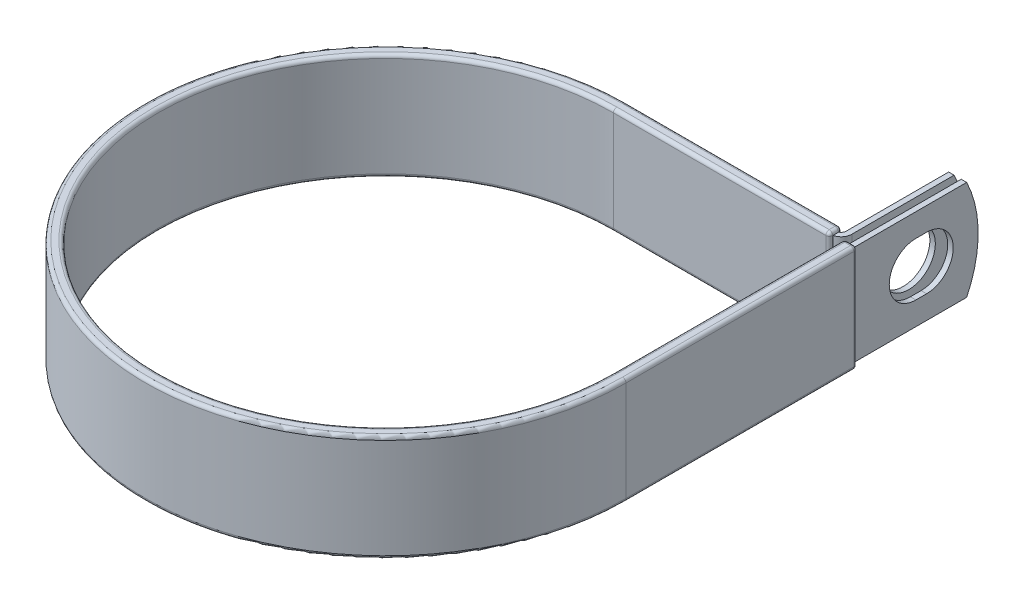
ISO-10303-21;
HEADER;
FILE_DESCRIPTION(('STEP AP214'),'2;1');
FILE_NAME('part.step','',(''),(''),'','','');
FILE_SCHEMA(('AUTOMOTIVE_DESIGN { 1 0 10303 214 1 1 1 1 }'));
ENDSEC;
DATA;
#1=APPLICATION_CONTEXT('core data for automotive mechanical design processes');
#2=APPLICATION_PROTOCOL_DEFINITION('international standard','automotive_design',2000,#1);
#3=PRODUCT_CONTEXT('',#1,'mechanical');
#4=PRODUCT('Part','Part','',(#3));
#5=PRODUCT_RELATED_PRODUCT_CATEGORY('part','',(#4));
#6=PRODUCT_DEFINITION_FORMATION('','',#4);
#7=PRODUCT_DEFINITION_CONTEXT('part definition',#1,'design');
#8=PRODUCT_DEFINITION('design','',#6,#7);
#9=PRODUCT_DEFINITION_SHAPE('','',#8);
#10=(LENGTH_UNIT() NAMED_UNIT(*) SI_UNIT(.MILLI.,.METRE.));
#11=(NAMED_UNIT(*) PLANE_ANGLE_UNIT() SI_UNIT($,.RADIAN.));
#12=(NAMED_UNIT(*) SI_UNIT($,.STERADIAN.) SOLID_ANGLE_UNIT());
#13=UNCERTAINTY_MEASURE_WITH_UNIT(LENGTH_MEASURE(1.E-05),#10,'distance_accuracy_value','');
#14=(GEOMETRIC_REPRESENTATION_CONTEXT(3) GLOBAL_UNCERTAINTY_ASSIGNED_CONTEXT((#13)) GLOBAL_UNIT_ASSIGNED_CONTEXT((#10,
#11,#12)) REPRESENTATION_CONTEXT('',''));
#15=CARTESIAN_POINT('',(0.,0.,0.));
#16=DIRECTION('',(0.,0.,1.));
#17=DIRECTION('',(1.,0.,0.));
#18=AXIS2_PLACEMENT_3D('',#15,#16,#17);
#19=CARTESIAN_POINT('',(50.01895,11.1125,-79.375));
#20=DIRECTION('',(1.,0.,0.));
#21=DIRECTION('',(0.,0.,-1.));
#22=AXIS2_PLACEMENT_3D('',#19,#20,#21);
#23=PLANE('',#22);
#24=CARTESIAN_POINT('',(50.01895,0.,-66.675));
#25=DIRECTION('',(1.,0.,0.));
#26=DIRECTION('',(0.,0.,-1.));
#27=AXIS2_PLACEMENT_3D('',#24,#25,#26);
#28=CIRCLE('',#27,5.9436);
#29=CARTESIAN_POINT('',(50.01895,0.,-72.6186));
#30=VERTEX_POINT('',#29);
#31=EDGE_CURVE('E442',#30,#30,#28,.F.);
#32=ORIENTED_EDGE('',*,*,#31,.T.);
#33=EDGE_LOOP('',(#32));
#34=FACE_BOUND('',#33,.T.);
#35=DIRECTION('',(0.,0.,1.));
#36=VECTOR('',#35,1.);
#37=CARTESIAN_POINT('',(50.01895,-11.1125,-79.375));
#38=LINE('',#37,#36);
#39=CARTESIAN_POINT('',(50.01895,-11.1125,-76.8151476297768));
#40=VERTEX_POINT('',#39);
#41=CARTESIAN_POINT('',(50.01895,-11.1125,-53.97119));
#42=VERTEX_POINT('',#41);
#43=EDGE_CURVE('E464',#40,#42,#38,.T.);
#44=ORIENTED_EDGE('',*,*,#43,.F.);
#45=CARTESIAN_POINT('',(50.01895,0.,-53.975));
#46=DIRECTION('',(1.,0.,0.));
#47=DIRECTION('',(0.,0.,-1.));
#48=AXIS2_PLACEMENT_3D('',#45,#46,#47);
#49=CIRCLE('',#48,25.4);
#50=CARTESIAN_POINT('',(50.01895,11.1125,-76.8151476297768));
#51=VERTEX_POINT('',#50);
#52=EDGE_CURVE('E401',#40,#51,#49,.T.);
#53=ORIENTED_EDGE('',*,*,#52,.T.);
#54=DIRECTION('',(0.,0.,1.));
#55=VECTOR('',#54,1.);
#56=CARTESIAN_POINT('',(50.01895,11.1125,-79.375));
#57=LINE('',#56,#55);
#58=CARTESIAN_POINT('',(50.01895,11.1125,-53.97119));
#59=VERTEX_POINT('',#58);
#60=EDGE_CURVE('E454',#51,#59,#57,.T.);
#61=ORIENTED_EDGE('',*,*,#60,.T.);
#62=DIRECTION('',(0.,-1.,0.));
#63=VECTOR('',#62,1.);
#64=CARTESIAN_POINT('',(50.01895,11.1125,-53.97119));
#65=LINE('',#64,#63);
#66=EDGE_CURVE('E471',#59,#42,#65,.T.);
#67=ORIENTED_EDGE('',*,*,#66,.T.);
#68=EDGE_LOOP('',(#44,#53,#61,#67));
#69=FACE_BOUND('',#68,.T.);
#70=ADVANCED_FACE('F36',(#34,#69),#23,.T.);
#71=CARTESIAN_POINT('',(48.79975,11.1125,-79.375));
#72=DIRECTION('',(1.,0.,0.));
#73=DIRECTION('',(0.,0.,-1.));
#74=AXIS2_PLACEMENT_3D('',#71,#72,#73);
#75=PLANE('',#74);
#76=CARTESIAN_POINT('',(48.79975,0.,-66.675));
#77=DIRECTION('',(-1.,0.,0.));
#78=DIRECTION('',(0.,0.,1.));
#79=AXIS2_PLACEMENT_3D('',#76,#77,#78);
#80=CIRCLE('',#79,5.9436);
#81=CARTESIAN_POINT('',(48.79975,0.,-60.7314));
#82=VERTEX_POINT('',#81);
#83=EDGE_CURVE('E439',#82,#82,#80,.T.);
#84=ORIENTED_EDGE('',*,*,#83,.F.);
#85=EDGE_LOOP('',(#84));
#86=FACE_BOUND('',#85,.T.);
#87=CARTESIAN_POINT('',(48.79975,0.,-53.975));
#88=DIRECTION('',(-1.,0.,0.));
#89=DIRECTION('',(0.,0.,1.));
#90=AXIS2_PLACEMENT_3D('',#87,#88,#89);
#91=CIRCLE('',#90,25.4);
#92=CARTESIAN_POINT('',(48.79975,11.1125,-76.8151476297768));
#93=VERTEX_POINT('',#92);
#94=CARTESIAN_POINT('',(48.79975,-11.1125,-76.8151476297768));
#95=VERTEX_POINT('',#94);
#96=EDGE_CURVE('E393',#93,#95,#91,.T.);
#97=ORIENTED_EDGE('',*,*,#96,.T.);
#98=DIRECTION('',(0.,0.,1.));
#99=VECTOR('',#98,1.);
#100=CARTESIAN_POINT('',(48.79975,-11.1125,-79.375));
#101=LINE('',#100,#99);
#102=CARTESIAN_POINT('',(48.79975,-11.1125,-53.97119));
#103=VERTEX_POINT('',#102);
#104=EDGE_CURVE('E466',#95,#103,#101,.T.);
#105=ORIENTED_EDGE('',*,*,#104,.T.);
#106=DIRECTION('',(0.,-1.,0.));
#107=VECTOR('',#106,1.);
#108=CARTESIAN_POINT('',(48.79975,11.1125,-53.97119));
#109=LINE('',#108,#107);
#110=CARTESIAN_POINT('',(48.79975,11.1125,-53.97119));
#111=VERTEX_POINT('',#110);
#112=EDGE_CURVE('E459',#111,#103,#109,.T.);
#113=ORIENTED_EDGE('',*,*,#112,.F.);
#114=DIRECTION('',(0.,0.,1.));
#115=VECTOR('',#114,1.);
#116=CARTESIAN_POINT('',(48.79975,11.1125,-79.375));
#117=LINE('',#116,#115);
#118=EDGE_CURVE('E456',#93,#111,#117,.T.);
#119=ORIENTED_EDGE('',*,*,#118,.F.);
#120=EDGE_LOOP('',(#97,#105,#113,#119));
#121=FACE_BOUND('',#120,.T.);
#122=ADVANCED_FACE('F770',(#86,#121),#75,.F.);
#123=CARTESIAN_POINT('',(0.,-11.1125,0.));
#124=DIRECTION('',(0.,1.,0.));
#125=DIRECTION('',(1.,0.,0.));
#126=AXIS2_PLACEMENT_3D('',#123,#124,#125);
#127=PLANE('',#126);
#128=CARTESIAN_POINT('',(47.64151,-11.1125,-53.97119));
#129=DIRECTION('',(0.,-1.,0.));
#130=DIRECTION('',(0.,0.,1.));
#131=AXIS2_PLACEMENT_3D('',#128,#129,#130);
#132=CIRCLE('',#131,2.37744);
#133=CARTESIAN_POINT('',(48.1647500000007,-11.1125,-51.6520434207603));
#134=VERTEX_POINT('',#133);
#135=EDGE_CURVE('E461',#42,#134,#132,.T.);
#136=ORIENTED_EDGE('',*,*,#135,.T.);
#137=DIRECTION('',(0.,0.,-1.));
#138=VECTOR('',#137,1.);
#139=CARTESIAN_POINT('',(48.1647500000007,-11.1125,-52.81295));
#140=LINE('',#139,#138);
#141=CARTESIAN_POINT('',(48.1647500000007,-11.1125,-52.8447));
#142=VERTEX_POINT('',#141);
#143=EDGE_CURVE('E350',#134,#142,#140,.T.);
#144=ORIENTED_EDGE('',*,*,#143,.T.);
#145=CARTESIAN_POINT('',(47.4027500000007,-11.1125,-52.8447));
#146=DIRECTION('',(0.,1.,0.));
#147=DIRECTION('',(0.,0.,1.));
#148=AXIS2_PLACEMENT_3D('',#145,#146,#147);
#149=CIRCLE('',#148,0.762);
#150=CARTESIAN_POINT('',(48.1593610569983,-11.1125,-52.9351638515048));
#151=VERTEX_POINT('',#150);
#152=EDGE_CURVE('E536',#142,#151,#149,.T.);
#153=ORIENTED_EDGE('',*,*,#152,.T.);
#154=CARTESIAN_POINT('',(47.64151,-11.1125,-53.97119));
#155=DIRECTION('',(0.,1.,0.));
#156=DIRECTION('',(1.,0.,0.));
#157=AXIS2_PLACEMENT_3D('',#154,#155,#156);
#158=CIRCLE('',#157,1.15824);
#159=EDGE_CURVE('E59',#103,#151,#158,.F.);
#160=ORIENTED_EDGE('',*,*,#159,.F.);
#161=ORIENTED_EDGE('',*,*,#104,.F.);
#162=DIRECTION('',(-1.,0.,0.));
#163=VECTOR('',#162,1.);
#164=CARTESIAN_POINT('',(52.81295,-11.1125,-76.8151476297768));
#165=LINE('',#164,#163);
#166=EDGE_CURVE('E480',#40,#95,#165,.T.);
#167=ORIENTED_EDGE('',*,*,#166,.F.);
#168=ORIENTED_EDGE('',*,*,#43,.T.);
#169=EDGE_LOOP('',(#136,#144,#153,#160,#161,#167,#168));
#170=FACE_BOUND('',#169,.T.);
#171=ADVANCED_FACE('F776',(#170),#127,.F.);
#172=CARTESIAN_POINT('',(0.,11.1125,0.));
#173=DIRECTION('',(0.,1.,0.));
#174=DIRECTION('',(1.,0.,0.));
#175=AXIS2_PLACEMENT_3D('',#172,#173,#174);
#176=PLANE('',#175);
#177=DIRECTION('',(0.,0.,-1.));
#178=VECTOR('',#177,1.);
#179=CARTESIAN_POINT('',(48.16475,11.1125,6.75614543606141E-13));
#180=LINE('',#179,#178);
#181=CARTESIAN_POINT('',(48.1647500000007,11.1125,-51.6520434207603));
#182=VERTEX_POINT('',#181);
#183=CARTESIAN_POINT('',(48.1647500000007,11.1125,-52.8447));
#184=VERTEX_POINT('',#183);
#185=EDGE_CURVE('E387',#182,#184,#180,.T.);
#186=ORIENTED_EDGE('',*,*,#185,.F.);
#187=CARTESIAN_POINT('',(47.64151,11.1125,-53.97119));
#188=DIRECTION('',(0.,-1.,0.));
#189=DIRECTION('',(0.,0.,1.));
#190=AXIS2_PLACEMENT_3D('',#187,#188,#189);
#191=CIRCLE('',#190,2.37744);
#192=EDGE_CURVE('E451',#59,#182,#191,.T.);
#193=ORIENTED_EDGE('',*,*,#192,.F.);
#194=ORIENTED_EDGE('',*,*,#60,.F.);
#195=DIRECTION('',(-1.,0.,0.));
#196=VECTOR('',#195,1.);
#197=CARTESIAN_POINT('',(52.81295,11.1125,-76.8151476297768));
#198=LINE('',#197,#196);
#199=EDGE_CURVE('E477',#51,#93,#198,.T.);
#200=ORIENTED_EDGE('',*,*,#199,.T.);
#201=ORIENTED_EDGE('',*,*,#118,.T.);
#202=CARTESIAN_POINT('',(47.64151,11.1125,-53.97119));
#203=DIRECTION('',(0.,1.,0.));
#204=DIRECTION('',(1.,0.,0.));
#205=AXIS2_PLACEMENT_3D('',#202,#203,#204);
#206=CIRCLE('',#205,1.15824);
#207=CARTESIAN_POINT('',(48.1593610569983,11.1125,-52.9351638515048));
#208=VERTEX_POINT('',#207);
#209=EDGE_CURVE('E52',#111,#208,#206,.F.);
#210=ORIENTED_EDGE('',*,*,#209,.T.);
#211=CARTESIAN_POINT('',(47.4027500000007,11.1125,-52.8447));
#212=DIRECTION('',(0.,1.,0.));
#213=DIRECTION('',(0.,0.,1.));
#214=AXIS2_PLACEMENT_3D('',#211,#212,#213);
#215=CIRCLE('',#214,0.762);
#216=EDGE_CURVE('E11',#208,#184,#215,.F.);
#217=ORIENTED_EDGE('',*,*,#216,.T.);
#218=EDGE_LOOP('',(#186,#193,#194,#200,#201,#210,#217));
#219=FACE_BOUND('',#218,.T.);
#220=ADVANCED_FACE('F784',(#219),#176,.T.);
#221=CARTESIAN_POINT('',(47.64151,11.1125,-53.97119));
#222=DIRECTION('',(0.,-1.,0.));
#223=DIRECTION('',(0.,0.,-1.));
#224=AXIS2_PLACEMENT_3D('',#221,#222,#223);
#225=CYLINDRICAL_SURFACE('',#224,2.37744);
#226=ORIENTED_EDGE('',*,*,#135,.F.);
#227=ORIENTED_EDGE('',*,*,#66,.F.);
#228=ORIENTED_EDGE('',*,*,#192,.T.);
#229=CARTESIAN_POINT('',(47.64151,11.1125,-53.97119));
#230=DIRECTION('',(0.,-1.,0.));
#231=DIRECTION('',(0.,0.,-1.));
#232=AXIS2_PLACEMENT_3D('',#229,#230,#231);
#233=CIRCLE('',#232,2.37744);
#234=CARTESIAN_POINT('',(47.64151,11.1125,-51.59375));
#235=VERTEX_POINT('',#234);
#236=EDGE_CURVE('E384',#235,#182,#233,.F.);
#237=ORIENTED_EDGE('',*,*,#236,.F.);
#238=DIRECTION('',(0.,-1.,0.));
#239=VECTOR('',#238,1.);
#240=CARTESIAN_POINT('',(47.64151,11.1125,-51.59375));
#241=LINE('',#240,#239);
#242=CARTESIAN_POINT('',(47.64151,-11.1125,-51.59375));
#243=VERTEX_POINT('',#242);
#244=EDGE_CURVE('E474',#235,#243,#241,.T.);
#245=ORIENTED_EDGE('',*,*,#244,.T.);
#246=CARTESIAN_POINT('',(47.64151,-11.1125,-53.97119));
#247=DIRECTION('',(0.,1.,0.));
#248=DIRECTION('',(0.,0.,1.));
#249=AXIS2_PLACEMENT_3D('',#246,#247,#248);
#250=CIRCLE('',#249,2.37744);
#251=EDGE_CURVE('E382',#134,#243,#250,.F.);
#252=ORIENTED_EDGE('',*,*,#251,.F.);
#253=EDGE_LOOP('',(#226,#227,#228,#237,#245,#252));
#254=FACE_BOUND('',#253,.T.);
#255=ADVANCED_FACE('F781',(#254),#225,.T.);
#256=CARTESIAN_POINT('',(47.64151,11.1125,-53.97119));
#257=DIRECTION('',(0.,-1.,0.));
#258=DIRECTION('',(0.,0.,-1.));
#259=AXIS2_PLACEMENT_3D('',#256,#257,#258);
#260=CYLINDRICAL_SURFACE('',#259,1.15824);
#261=ORIENTED_EDGE('',*,*,#159,.T.);
#262=DIRECTION('',(0.,1.,0.));
#263=VECTOR('',#262,1.);
#264=CARTESIAN_POINT('',(48.1593610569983,-11.1125,-52.9351638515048));
#265=LINE('',#264,#263);
#266=EDGE_CURVE('E45',#151,#208,#265,.T.);
#267=ORIENTED_EDGE('',*,*,#266,.T.);
#268=ORIENTED_EDGE('',*,*,#209,.F.);
#269=ORIENTED_EDGE('',*,*,#112,.T.);
#270=EDGE_LOOP('',(#261,#267,#268,#269));
#271=FACE_BOUND('',#270,.T.);
#272=ADVANCED_FACE('F783',(#271),#260,.F.);
#273=CARTESIAN_POINT('',(66.8299894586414,0.,-66.675));
#274=DIRECTION('',(-1.,0.,0.));
#275=DIRECTION('',(0.,0.,1.));
#276=AXIS2_PLACEMENT_3D('',#273,#274,#275);
#277=CYLINDRICAL_SURFACE('',#276,5.9436);
#278=ORIENTED_EDGE('',*,*,#83,.T.);
#279=EDGE_LOOP('',(#278));
#280=FACE_BOUND('',#279,.T.);
#281=ORIENTED_EDGE('',*,*,#31,.F.);
#282=EDGE_LOOP('',(#281));
#283=FACE_BOUND('',#282,.T.);
#284=ADVANCED_FACE('F790',(#280,#283),#277,.F.);
#285=CARTESIAN_POINT('',(52.81295,0.,-53.975));
#286=DIRECTION('',(-1.,0.,0.));
#287=DIRECTION('',(0.,0.,1.));
#288=AXIS2_PLACEMENT_3D('',#285,#286,#287);
#289=CYLINDRICAL_SURFACE('',#288,25.4);
#290=ORIENTED_EDGE('',*,*,#52,.F.);
#291=ORIENTED_EDGE('',*,*,#166,.T.);
#292=ORIENTED_EDGE('',*,*,#96,.F.);
#293=ORIENTED_EDGE('',*,*,#199,.F.);
#294=EDGE_LOOP('',(#290,#291,#292,#293));
#295=FACE_BOUND('',#294,.T.);
#296=ADVANCED_FACE('F841',(#295),#289,.T.);
#297=CARTESIAN_POINT('',(7.23713667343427E-13,-11.1125,-51.59375));
#298=DIRECTION('',(0.,0.,1.));
#299=DIRECTION('',(1.,0.,0.));
#300=AXIS2_PLACEMENT_3D('',#297,#298,#299);
#301=PLANE('',#300);
#302=DIRECTION('',(1.,0.,0.));
#303=VECTOR('',#302,1.);
#304=CARTESIAN_POINT('',(7.23713667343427E-13,-11.1125,-51.59375));
#305=LINE('',#304,#303);
#306=CARTESIAN_POINT('',(48.1647500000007,-11.1125,-51.59375));
#307=VERTEX_POINT('',#306);
#308=EDGE_CURVE('E357',#243,#307,#305,.T.);
#309=ORIENTED_EDGE('',*,*,#308,.F.);
#310=ORIENTED_EDGE('',*,*,#244,.F.);
#311=DIRECTION('',(1.,0.,0.));
#312=VECTOR('',#311,1.);
#313=CARTESIAN_POINT('',(7.23713667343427E-13,11.1125,-51.59375));
#314=LINE('',#313,#312);
#315=CARTESIAN_POINT('',(48.1647500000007,11.1125,-51.59375));
#316=VERTEX_POINT('',#315);
#317=EDGE_CURVE('E359',#235,#316,#314,.T.);
#318=ORIENTED_EDGE('',*,*,#317,.T.);
#319=DIRECTION('',(0.,-1.,0.));
#320=VECTOR('',#319,1.);
#321=CARTESIAN_POINT('',(48.1647500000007,-11.1125,-51.59375));
#322=LINE('',#321,#320);
#323=EDGE_CURVE('E289',#316,#307,#322,.T.);
#324=ORIENTED_EDGE('',*,*,#323,.T.);
#325=EDGE_LOOP('',(#309,#310,#318,#324));
#326=FACE_BOUND('',#325,.T.);
#327=ADVANCED_FACE('F813',(#326),#301,.F.);
#328=CARTESIAN_POINT('',(48.1647500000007,-11.14425,-51.562));
#329=DIRECTION('',(1.,0.,0.));
#330=DIRECTION('',(0.,0.,-1.));
#331=AXIS2_PLACEMENT_3D('',#328,#329,#330);
#332=PLANE('',#331);
#333=DIRECTION('',(0.,0.,-1.));
#334=VECTOR('',#333,1.);
#335=CARTESIAN_POINT('',(48.1647500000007,-11.14425,-52.8447));
#336=LINE('',#335,#334);
#337=CARTESIAN_POINT('',(48.1647500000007,-11.14425,-51.562));
#338=VERTEX_POINT('',#337);
#339=CARTESIAN_POINT('',(48.1647500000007,-11.14425,-52.8447));
#340=VERTEX_POINT('',#339);
#341=EDGE_CURVE('E490',#338,#340,#336,.T.);
#342=ORIENTED_EDGE('',*,*,#341,.T.);
#343=DIRECTION('',(0.,1.,0.));
#344=VECTOR('',#343,1.);
#345=CARTESIAN_POINT('',(48.1647500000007,-11.14425,-52.8447));
#346=LINE('',#345,#344);
#347=EDGE_CURVE('E494',#340,#142,#346,.T.);
#348=ORIENTED_EDGE('',*,*,#347,.T.);
#349=ORIENTED_EDGE('',*,*,#143,.F.);
#350=EDGE_CURVE('E351',#307,#134,#140,.T.);
#351=ORIENTED_EDGE('',*,*,#350,.F.);
#352=ORIENTED_EDGE('',*,*,#323,.F.);
#353=DIRECTION('',(0.,0.,1.));
#354=VECTOR('',#353,1.);
#355=CARTESIAN_POINT('',(48.1647500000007,11.1125,-51.59375));
#356=LINE('',#355,#354);
#357=EDGE_CURVE('E354',#182,#316,#356,.T.);
#358=ORIENTED_EDGE('',*,*,#357,.F.);
#359=ORIENTED_EDGE('',*,*,#185,.T.);
#360=DIRECTION('',(0.,1.,0.));
#361=VECTOR('',#360,1.);
#362=CARTESIAN_POINT('',(48.1647500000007,-11.14425,-52.8447));
#363=LINE('',#362,#361);
#364=CARTESIAN_POINT('',(48.1647500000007,11.14425,-52.8447));
#365=VERTEX_POINT('',#364);
#366=EDGE_CURVE('E492',#184,#365,#363,.T.);
#367=ORIENTED_EDGE('',*,*,#366,.T.);
#368=DIRECTION('',(0.,0.,1.));
#369=VECTOR('',#368,1.);
#370=CARTESIAN_POINT('',(48.1647500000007,11.14425,-51.562));
#371=LINE('',#370,#369);
#372=CARTESIAN_POINT('',(48.1647500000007,11.14425,-51.562));
#373=VERTEX_POINT('',#372);
#374=EDGE_CURVE('E486',#365,#373,#371,.T.);
#375=ORIENTED_EDGE('',*,*,#374,.T.);
#376=DIRECTION('',(0.,-1.,0.));
#377=VECTOR('',#376,1.);
#378=CARTESIAN_POINT('',(48.1647500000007,-11.14425,-51.562));
#379=LINE('',#378,#377);
#380=EDGE_CURVE('E488',#373,#338,#379,.T.);
#381=ORIENTED_EDGE('',*,*,#380,.T.);
#382=EDGE_LOOP('',(#342,#348,#349,#351,#352,#358,#359,#367,#375,#381));
#383=FACE_BOUND('',#382,.T.);
#384=ADVANCED_FACE('F809',(#383),#332,.T.);
#385=CARTESIAN_POINT('',(7.412609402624E-13,-11.14425,-52.8447));
#386=DIRECTION('',(1.,0.,0.));
#387=DIRECTION('',(0.,0.,-1.));
#388=AXIS2_PLACEMENT_3D('',#385,#386,#387);
#389=CYLINDRICAL_SURFACE('',#388,0.761999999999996);
#390=DIRECTION('',(1.,0.,0.));
#391=VECTOR('',#390,1.);
#392=CARTESIAN_POINT('',(7.51949634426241E-13,-11.14425,-53.6067));
#393=LINE('',#392,#391);
#394=CARTESIAN_POINT('',(7.51949634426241E-13,-11.14425,-53.6067));
#395=VERTEX_POINT('',#394);
#396=CARTESIAN_POINT('',(47.4027500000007,-11.14425,-53.6067));
#397=VERTEX_POINT('',#396);
#398=EDGE_CURVE('E376',#395,#397,#393,.T.);
#399=ORIENTED_EDGE('',*,*,#398,.T.);
#400=CARTESIAN_POINT('',(47.4027500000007,-11.14425,-52.8447));
#401=DIRECTION('',(1.,0.,0.));
#402=DIRECTION('',(0.,0.,-1.));
#403=AXIS2_PLACEMENT_3D('',#400,#401,#402);
#404=CIRCLE('',#403,0.761999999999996);
#405=CARTESIAN_POINT('',(47.4027500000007,-11.90625,-52.8447));
#406=VERTEX_POINT('',#405);
#407=EDGE_CURVE('E499',#397,#406,#404,.F.);
#408=ORIENTED_EDGE('',*,*,#407,.T.);
#409=DIRECTION('',(1.,0.,0.));
#410=VECTOR('',#409,1.);
#411=CARTESIAN_POINT('',(7.412609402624E-13,-11.90625,-52.8447));
#412=LINE('',#411,#410);
#413=CARTESIAN_POINT('',(7.412609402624E-13,-11.90625,-52.8447));
#414=VERTEX_POINT('',#413);
#415=EDGE_CURVE('E379',#414,#406,#412,.T.);
#416=ORIENTED_EDGE('',*,*,#415,.F.);
#417=CARTESIAN_POINT('',(7.412609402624E-13,-11.14425,-52.8447));
#418=DIRECTION('',(1.,0.,0.));
#419=DIRECTION('',(0.,0.,1.));
#420=AXIS2_PLACEMENT_3D('',#417,#418,#419);
#421=CIRCLE('',#420,0.761999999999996);
#422=EDGE_CURVE('E327',#414,#395,#421,.T.);
#423=ORIENTED_EDGE('',*,*,#422,.T.);
#424=EDGE_LOOP('',(#399,#408,#416,#423));
#425=FACE_BOUND('',#424,.T.);
#426=ADVANCED_FACE('F652',(#425),#389,.T.);
#427=CARTESIAN_POINT('',(7.51949634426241E-13,11.14425,-53.6067));
#428=DIRECTION('',(0.,0.,-1.));
#429=DIRECTION('',(0.,1.,0.));
#430=AXIS2_PLACEMENT_3D('',#427,#428,#429);
#431=PLANE('',#430);
#432=DIRECTION('',(1.,0.,0.));
#433=VECTOR('',#432,1.);
#434=CARTESIAN_POINT('',(7.51949634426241E-13,11.14425,-53.6067));
#435=LINE('',#434,#433);
#436=CARTESIAN_POINT('',(7.51949634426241E-13,11.14425,-53.6067));
#437=VERTEX_POINT('',#436);
#438=CARTESIAN_POINT('',(47.4027500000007,11.14425,-53.6067));
#439=VERTEX_POINT('',#438);
#440=EDGE_CURVE('E373',#437,#439,#435,.T.);
#441=ORIENTED_EDGE('',*,*,#440,.T.);
#442=DIRECTION('',(0.,1.,0.));
#443=VECTOR('',#442,1.);
#444=CARTESIAN_POINT('',(47.4027500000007,11.14425,-53.6067));
#445=LINE('',#444,#443);
#446=EDGE_CURVE('E497',#439,#397,#445,.F.);
#447=ORIENTED_EDGE('',*,*,#446,.T.);
#448=ORIENTED_EDGE('',*,*,#398,.F.);
#449=DIRECTION('',(0.,1.,0.));
#450=VECTOR('',#449,1.);
#451=CARTESIAN_POINT('',(7.51949634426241E-13,11.14425,-53.6067));
#452=LINE('',#451,#450);
#453=EDGE_CURVE('E324',#395,#437,#452,.T.);
#454=ORIENTED_EDGE('',*,*,#453,.T.);
#455=EDGE_LOOP('',(#441,#447,#448,#454));
#456=FACE_BOUND('',#455,.T.);
#457=ADVANCED_FACE('F658',(#456),#431,.T.);
#458=CARTESIAN_POINT('',(7.412609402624E-13,11.14425,-52.8447));
#459=DIRECTION('',(1.,0.,0.));
#460=DIRECTION('',(0.,0.,-1.));
#461=AXIS2_PLACEMENT_3D('',#458,#459,#460);
#462=CYLINDRICAL_SURFACE('',#461,0.762);
#463=DIRECTION('',(1.,0.,0.));
#464=VECTOR('',#463,1.);
#465=CARTESIAN_POINT('',(7.412609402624E-13,11.90625,-52.8447));
#466=LINE('',#465,#464);
#467=CARTESIAN_POINT('',(7.412609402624E-13,11.90625,-52.8447));
#468=VERTEX_POINT('',#467);
#469=CARTESIAN_POINT('',(47.4027500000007,11.90625,-52.8447));
#470=VERTEX_POINT('',#469);
#471=EDGE_CURVE('E370',#468,#470,#466,.T.);
#472=ORIENTED_EDGE('',*,*,#471,.T.);
#473=CARTESIAN_POINT('',(47.4027500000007,11.14425,-52.8447));
#474=DIRECTION('',(1.,0.,0.));
#475=DIRECTION('',(0.,0.,-1.));
#476=AXIS2_PLACEMENT_3D('',#473,#474,#475);
#477=CIRCLE('',#476,0.762);
#478=EDGE_CURVE('E483',#470,#439,#477,.F.);
#479=ORIENTED_EDGE('',*,*,#478,.T.);
#480=ORIENTED_EDGE('',*,*,#440,.F.);
#481=CARTESIAN_POINT('',(7.412609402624E-13,11.14425,-52.8447));
#482=DIRECTION('',(1.,0.,0.));
#483=DIRECTION('',(0.,0.,1.));
#484=AXIS2_PLACEMENT_3D('',#481,#482,#483);
#485=CIRCLE('',#484,0.762);
#486=EDGE_CURVE('E321',#437,#468,#485,.T.);
#487=ORIENTED_EDGE('',*,*,#486,.T.);
#488=EDGE_LOOP('',(#472,#479,#480,#487));
#489=FACE_BOUND('',#488,.T.);
#490=ADVANCED_FACE('F662',(#489),#462,.T.);
#491=CARTESIAN_POINT('',(7.232683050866E-13,11.14425,-51.562));
#492=DIRECTION('',(1.,0.,0.));
#493=DIRECTION('',(0.,0.,-1.));
#494=AXIS2_PLACEMENT_3D('',#491,#492,#493);
#495=CYLINDRICAL_SURFACE('',#494,0.762);
#496=DIRECTION('',(1.,0.,0.));
#497=VECTOR('',#496,1.);
#498=CARTESIAN_POINT('',(7.12579610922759E-13,11.14425,-50.8));
#499=LINE('',#498,#497);
#500=CARTESIAN_POINT('',(7.12579610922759E-13,11.14425,-50.8));
#501=VERTEX_POINT('',#500);
#502=CARTESIAN_POINT('',(47.4027500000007,11.14425,-50.8));
#503=VERTEX_POINT('',#502);
#504=EDGE_CURVE('E364',#501,#503,#499,.T.);
#505=ORIENTED_EDGE('',*,*,#504,.T.);
#506=CARTESIAN_POINT('',(47.4027500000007,11.14425,-51.562));
#507=DIRECTION('',(1.,0.,0.));
#508=DIRECTION('',(0.,0.,-1.));
#509=AXIS2_PLACEMENT_3D('',#506,#507,#508);
#510=CIRCLE('',#509,0.762);
#511=CARTESIAN_POINT('',(47.4027500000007,11.90625,-51.562));
#512=VERTEX_POINT('',#511);
#513=EDGE_CURVE('E509',#503,#512,#510,.F.);
#514=ORIENTED_EDGE('',*,*,#513,.T.);
#515=DIRECTION('',(1.,0.,0.));
#516=VECTOR('',#515,1.);
#517=CARTESIAN_POINT('',(7.232683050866E-13,11.90625,-51.562));
#518=LINE('',#517,#516);
#519=CARTESIAN_POINT('',(7.232683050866E-13,11.90625,-51.562));
#520=VERTEX_POINT('',#519);
#521=EDGE_CURVE('E367',#520,#512,#518,.T.);
#522=ORIENTED_EDGE('',*,*,#521,.F.);
#523=CARTESIAN_POINT('',(7.232683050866E-13,11.14425,-51.562));
#524=DIRECTION('',(1.,0.,0.));
#525=DIRECTION('',(0.,0.,1.));
#526=AXIS2_PLACEMENT_3D('',#523,#524,#525);
#527=CIRCLE('',#526,0.762);
#528=EDGE_CURVE('E318',#520,#501,#527,.T.);
#529=ORIENTED_EDGE('',*,*,#528,.T.);
#530=EDGE_LOOP('',(#505,#514,#522,#529));
#531=FACE_BOUND('',#530,.T.);
#532=ADVANCED_FACE('F703',(#531),#495,.T.);
#533=CARTESIAN_POINT('',(7.12579610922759E-13,-11.14425,-50.8));
#534=DIRECTION('',(0.,0.,1.));
#535=DIRECTION('',(1.,0.,0.));
#536=AXIS2_PLACEMENT_3D('',#533,#534,#535);
#537=PLANE('',#536);
#538=DIRECTION('',(1.,0.,0.));
#539=VECTOR('',#538,1.);
#540=CARTESIAN_POINT('',(7.12579610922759E-13,-11.14425,-50.8));
#541=LINE('',#540,#539);
#542=CARTESIAN_POINT('',(7.12579610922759E-13,-11.14425,-50.8));
#543=VERTEX_POINT('',#542);
#544=CARTESIAN_POINT('',(47.4027500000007,-11.14425,-50.8));
#545=VERTEX_POINT('',#544);
#546=EDGE_CURVE('E361',#543,#545,#541,.T.);
#547=ORIENTED_EDGE('',*,*,#546,.T.);
#548=DIRECTION('',(0.,-1.,0.));
#549=VECTOR('',#548,1.);
#550=CARTESIAN_POINT('',(47.4027500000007,-11.14425,-50.8));
#551=LINE('',#550,#549);
#552=EDGE_CURVE('E507',#545,#503,#551,.F.);
#553=ORIENTED_EDGE('',*,*,#552,.T.);
#554=ORIENTED_EDGE('',*,*,#504,.F.);
#555=DIRECTION('',(0.,-1.,0.));
#556=VECTOR('',#555,1.);
#557=CARTESIAN_POINT('',(7.12579610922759E-13,-11.14425,-50.8));
#558=LINE('',#557,#556);
#559=EDGE_CURVE('E309',#501,#543,#558,.T.);
#560=ORIENTED_EDGE('',*,*,#559,.T.);
#561=EDGE_LOOP('',(#547,#553,#554,#560));
#562=FACE_BOUND('',#561,.T.);
#563=ADVANCED_FACE('F701',(#562),#537,.T.);
#564=CARTESIAN_POINT('',(7.232683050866E-13,-11.14425,-51.562));
#565=DIRECTION('',(1.,0.,0.));
#566=DIRECTION('',(0.,0.,-1.));
#567=AXIS2_PLACEMENT_3D('',#564,#565,#566);
#568=CYLINDRICAL_SURFACE('',#567,0.761999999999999);
#569=DIRECTION('',(1.,0.,0.));
#570=VECTOR('',#569,1.);
#571=CARTESIAN_POINT('',(7.232683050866E-13,-11.90625,-51.562));
#572=LINE('',#571,#570);
#573=CARTESIAN_POINT('',(7.232683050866E-13,-11.90625,-51.562));
#574=VERTEX_POINT('',#573);
#575=CARTESIAN_POINT('',(47.4027500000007,-11.90625,-51.562));
#576=VERTEX_POINT('',#575);
#577=EDGE_CURVE('E285',#574,#576,#572,.T.);
#578=ORIENTED_EDGE('',*,*,#577,.T.);
#579=CARTESIAN_POINT('',(47.4027500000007,-11.14425,-51.562));
#580=DIRECTION('',(1.,0.,0.));
#581=DIRECTION('',(0.,0.,-1.));
#582=AXIS2_PLACEMENT_3D('',#579,#580,#581);
#583=CIRCLE('',#582,0.761999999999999);
#584=EDGE_CURVE('E505',#576,#545,#583,.F.);
#585=ORIENTED_EDGE('',*,*,#584,.T.);
#586=ORIENTED_EDGE('',*,*,#546,.F.);
#587=CARTESIAN_POINT('',(7.232683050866E-13,-11.14425,-51.562));
#588=DIRECTION('',(1.,0.,0.));
#589=DIRECTION('',(0.,0.,-1.));
#590=AXIS2_PLACEMENT_3D('',#587,#588,#589);
#591=CIRCLE('',#590,0.761999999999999);
#592=EDGE_CURVE('E306',#543,#574,#591,.T.);
#593=ORIENTED_EDGE('',*,*,#592,.T.);
#594=EDGE_LOOP('',(#578,#585,#586,#593));
#595=FACE_BOUND('',#594,.T.);
#596=ADVANCED_FACE('F691',(#595),#568,.T.);
#597=CARTESIAN_POINT('',(0.,-11.14425,0.));
#598=DIRECTION('',(0.,-1.,0.));
#599=DIRECTION('',(0.,0.,-1.));
#600=AXIS2_PLACEMENT_3D('',#597,#598,#599);
#601=TOROIDAL_SURFACE('',#600,52.8447,0.761999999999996);
#602=CARTESIAN_POINT('',(52.8447,-11.14425,0.));
#603=DIRECTION('',(0.,0.,1.));
#604=DIRECTION('',(-1.,0.,0.));
#605=AXIS2_PLACEMENT_3D('',#602,#603,#604);
#606=CIRCLE('',#605,0.761999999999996);
#607=CARTESIAN_POINT('',(52.8447,-11.90625,0.));
#608=VERTEX_POINT('',#607);
#609=CARTESIAN_POINT('',(53.6067,-11.14425,0.));
#610=VERTEX_POINT('',#609);
#611=EDGE_CURVE('E300',#608,#610,#606,.T.);
#612=ORIENTED_EDGE('',*,*,#611,.T.);
#613=CARTESIAN_POINT('',(0.,-11.14425,0.));
#614=DIRECTION('',(0.,-1.,0.));
#615=DIRECTION('',(0.,0.,-1.));
#616=AXIS2_PLACEMENT_3D('',#613,#614,#615);
#617=CIRCLE('',#616,53.6067);
#618=EDGE_CURVE('E343',#610,#395,#617,.T.);
#619=ORIENTED_EDGE('',*,*,#618,.T.);
#620=ORIENTED_EDGE('',*,*,#422,.F.);
#621=CARTESIAN_POINT('',(0.,-11.90625,0.));
#622=DIRECTION('',(0.,-1.,0.));
#623=DIRECTION('',(0.,0.,-1.));
#624=AXIS2_PLACEMENT_3D('',#621,#622,#623);
#625=CIRCLE('',#624,52.8447);
#626=EDGE_CURVE('E290',#608,#414,#625,.T.);
#627=ORIENTED_EDGE('',*,*,#626,.F.);
#628=EDGE_LOOP('',(#612,#619,#620,#627));
#629=FACE_BOUND('',#628,.T.);
#630=ADVANCED_FACE('F649',(#629),#601,.T.);
#631=CARTESIAN_POINT('',(0.,11.1125,0.));
#632=DIRECTION('',(0.,-1.,0.));
#633=DIRECTION('',(0.,0.,-1.));
#634=AXIS2_PLACEMENT_3D('',#631,#632,#633);
#635=CYLINDRICAL_SURFACE('',#634,53.6067);
#636=DIRECTION('',(0.,1.,0.));
#637=VECTOR('',#636,1.);
#638=CARTESIAN_POINT('',(53.6067,11.14425,0.));
#639=LINE('',#638,#637);
#640=CARTESIAN_POINT('',(53.6067,11.14425,0.));
#641=VERTEX_POINT('',#640);
#642=EDGE_CURVE('E637',#610,#641,#639,.T.);
#643=ORIENTED_EDGE('',*,*,#642,.T.);
#644=CARTESIAN_POINT('',(0.,11.14425,0.));
#645=DIRECTION('',(0.,-1.,0.));
#646=DIRECTION('',(0.,0.,-1.));
#647=AXIS2_PLACEMENT_3D('',#644,#645,#646);
#648=CIRCLE('',#647,53.6067);
#649=EDGE_CURVE('E340',#641,#437,#648,.T.);
#650=ORIENTED_EDGE('',*,*,#649,.T.);
#651=ORIENTED_EDGE('',*,*,#453,.F.);
#652=ORIENTED_EDGE('',*,*,#618,.F.);
#653=EDGE_LOOP('',(#643,#650,#651,#652));
#654=FACE_BOUND('',#653,.T.);
#655=ADVANCED_FACE('F655',(#654),#635,.T.);
#656=CARTESIAN_POINT('',(0.,11.14425,0.));
#657=DIRECTION('',(0.,-1.,0.));
#658=DIRECTION('',(0.,0.,-1.));
#659=AXIS2_PLACEMENT_3D('',#656,#657,#658);
#660=TOROIDAL_SURFACE('',#659,52.8447,0.762);
#661=CARTESIAN_POINT('',(52.8447,11.14425,0.));
#662=DIRECTION('',(0.,0.,1.));
#663=DIRECTION('',(-1.,0.,0.));
#664=AXIS2_PLACEMENT_3D('',#661,#662,#663);
#665=CIRCLE('',#664,0.762);
#666=CARTESIAN_POINT('',(52.8447,11.90625,0.));
#667=VERTEX_POINT('',#666);
#668=EDGE_CURVE('E716',#641,#667,#665,.T.);
#669=ORIENTED_EDGE('',*,*,#668,.T.);
#670=CARTESIAN_POINT('',(0.,11.90625,0.));
#671=DIRECTION('',(0.,-1.,0.));
#672=DIRECTION('',(0.,0.,-1.));
#673=AXIS2_PLACEMENT_3D('',#670,#671,#672);
#674=CIRCLE('',#673,52.8447);
#675=EDGE_CURVE('E337',#667,#468,#674,.T.);
#676=ORIENTED_EDGE('',*,*,#675,.T.);
#677=ORIENTED_EDGE('',*,*,#486,.F.);
#678=ORIENTED_EDGE('',*,*,#649,.F.);
#679=EDGE_LOOP('',(#669,#676,#677,#678));
#680=FACE_BOUND('',#679,.T.);
#681=ADVANCED_FACE('F660',(#680),#660,.T.);
#682=CARTESIAN_POINT('',(0.,11.14425,0.));
#683=DIRECTION('',(0.,-1.,0.));
#684=DIRECTION('',(0.,0.,-1.));
#685=AXIS2_PLACEMENT_3D('',#682,#683,#684);
#686=TOROIDAL_SURFACE('',#685,51.562,0.762);
#687=CARTESIAN_POINT('',(51.562,11.14425,0.));
#688=DIRECTION('',(0.,0.,1.));
#689=DIRECTION('',(-1.,0.,0.));
#690=AXIS2_PLACEMENT_3D('',#687,#688,#689);
#691=CIRCLE('',#690,0.762);
#692=CARTESIAN_POINT('',(51.562,11.90625,0.));
#693=VERTEX_POINT('',#692);
#694=CARTESIAN_POINT('',(50.8,11.14425,0.));
#695=VERTEX_POINT('',#694);
#696=EDGE_CURVE('E712',#693,#695,#691,.T.);
#697=ORIENTED_EDGE('',*,*,#696,.T.);
#698=CARTESIAN_POINT('',(0.,11.14425,0.));
#699=DIRECTION('',(0.,-1.,0.));
#700=DIRECTION('',(0.,0.,-1.));
#701=AXIS2_PLACEMENT_3D('',#698,#699,#700);
#702=CIRCLE('',#701,50.8);
#703=EDGE_CURVE('E331',#695,#501,#702,.T.);
#704=ORIENTED_EDGE('',*,*,#703,.T.);
#705=ORIENTED_EDGE('',*,*,#528,.F.);
#706=CARTESIAN_POINT('',(0.,11.90625,0.));
#707=DIRECTION('',(0.,-1.,0.));
#708=DIRECTION('',(0.,0.,-1.));
#709=AXIS2_PLACEMENT_3D('',#706,#707,#708);
#710=CIRCLE('',#709,51.562);
#711=EDGE_CURVE('E334',#693,#520,#710,.T.);
#712=ORIENTED_EDGE('',*,*,#711,.F.);
#713=EDGE_LOOP('',(#697,#704,#705,#712));
#714=FACE_BOUND('',#713,.T.);
#715=ADVANCED_FACE('F710',(#714),#686,.T.);
#716=CARTESIAN_POINT('',(0.,11.1125,0.));
#717=DIRECTION('',(0.,-1.,0.));
#718=DIRECTION('',(0.,0.,-1.));
#719=AXIS2_PLACEMENT_3D('',#716,#717,#718);
#720=CYLINDRICAL_SURFACE('',#719,50.8);
#721=DIRECTION('',(0.,-1.,0.));
#722=VECTOR('',#721,1.);
#723=CARTESIAN_POINT('',(50.8,-11.14425,0.));
#724=LINE('',#723,#722);
#725=CARTESIAN_POINT('',(50.8,-11.14425,0.));
#726=VERTEX_POINT('',#725);
#727=EDGE_CURVE('E715',#695,#726,#724,.T.);
#728=ORIENTED_EDGE('',*,*,#727,.T.);
#729=CARTESIAN_POINT('',(0.,-11.14425,0.));
#730=DIRECTION('',(0.,-1.,0.));
#731=DIRECTION('',(0.,0.,-1.));
#732=AXIS2_PLACEMENT_3D('',#729,#730,#731);
#733=CIRCLE('',#732,50.8);
#734=EDGE_CURVE('E296',#726,#543,#733,.T.);
#735=ORIENTED_EDGE('',*,*,#734,.T.);
#736=ORIENTED_EDGE('',*,*,#559,.F.);
#737=ORIENTED_EDGE('',*,*,#703,.F.);
#738=EDGE_LOOP('',(#728,#735,#736,#737));
#739=FACE_BOUND('',#738,.T.);
#740=ADVANCED_FACE('F708',(#739),#720,.F.);
#741=CARTESIAN_POINT('',(0.,-11.14425,0.));
#742=DIRECTION('',(0.,-1.,0.));
#743=DIRECTION('',(0.,0.,-1.));
#744=AXIS2_PLACEMENT_3D('',#741,#742,#743);
#745=TOROIDAL_SURFACE('',#744,51.562,0.761999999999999);
#746=CARTESIAN_POINT('',(51.562,-11.14425,0.));
#747=DIRECTION('',(0.,0.,1.));
#748=DIRECTION('',(1.,0.,0.));
#749=AXIS2_PLACEMENT_3D('',#746,#747,#748);
#750=CIRCLE('',#749,0.761999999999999);
#751=CARTESIAN_POINT('',(51.562,-11.90625,0.));
#752=VERTEX_POINT('',#751);
#753=EDGE_CURVE('E293',#726,#752,#750,.T.);
#754=ORIENTED_EDGE('',*,*,#753,.T.);
#755=CARTESIAN_POINT('',(0.,-11.90625,0.));
#756=DIRECTION('',(0.,-1.,0.));
#757=DIRECTION('',(0.,0.,-1.));
#758=AXIS2_PLACEMENT_3D('',#755,#756,#757);
#759=CIRCLE('',#758,51.562);
#760=EDGE_CURVE('E277',#752,#574,#759,.T.);
#761=ORIENTED_EDGE('',*,*,#760,.T.);
#762=ORIENTED_EDGE('',*,*,#592,.F.);
#763=ORIENTED_EDGE('',*,*,#734,.F.);
#764=EDGE_LOOP('',(#754,#761,#762,#763));
#765=FACE_BOUND('',#764,.T.);
#766=ADVANCED_FACE('F294',(#765),#745,.T.);
#767=CARTESIAN_POINT('',(51.562,-11.14425,0.));
#768=DIRECTION('',(0.,0.,-1.));
#769=DIRECTION('',(-1.,0.,0.));
#770=AXIS2_PLACEMENT_3D('',#767,#768,#769);
#771=CYLINDRICAL_SURFACE('',#770,0.761999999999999);
#772=DIRECTION('',(0.,0.,-1.));
#773=VECTOR('',#772,1.);
#774=CARTESIAN_POINT('',(50.8,-11.14425,0.));
#775=LINE('',#774,#773);
#776=CARTESIAN_POINT('',(50.8,-11.14425,-50.83175));
#777=VERTEX_POINT('',#776);
#778=EDGE_CURVE('E723',#726,#777,#775,.T.);
#779=ORIENTED_EDGE('',*,*,#778,.T.);
#780=CARTESIAN_POINT('',(51.562,-11.14425,-50.83175));
#781=DIRECTION('',(0.,0.,-1.));
#782=DIRECTION('',(-1.,0.,0.));
#783=AXIS2_PLACEMENT_3D('',#780,#781,#782);
#784=CIRCLE('',#783,0.761999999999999);
#785=CARTESIAN_POINT('',(51.562,-11.90625,-50.83175));
#786=VERTEX_POINT('',#785);
#787=EDGE_CURVE('E305',#777,#786,#784,.F.);
#788=ORIENTED_EDGE('',*,*,#787,.T.);
#789=DIRECTION('',(0.,0.,-1.));
#790=VECTOR('',#789,1.);
#791=CARTESIAN_POINT('',(51.562,-11.90625,0.));
#792=LINE('',#791,#790);
#793=EDGE_CURVE('E282',#752,#786,#792,.T.);
#794=ORIENTED_EDGE('',*,*,#793,.F.);
#795=ORIENTED_EDGE('',*,*,#753,.F.);
#796=EDGE_LOOP('',(#779,#788,#794,#795));
#797=FACE_BOUND('',#796,.T.);
#798=ADVANCED_FACE('F303',(#797),#771,.T.);
#799=CARTESIAN_POINT('',(52.8447,-11.90625,0.));
#800=DIRECTION('',(0.,1.,0.));
#801=DIRECTION('',(-1.,0.,0.));
#802=AXIS2_PLACEMENT_3D('',#799,#800,#801);
#803=PLANE('',#802);
#804=ORIENTED_EDGE('',*,*,#415,.T.);
#805=DIRECTION('',(0.,0.,-1.));
#806=VECTOR('',#805,1.);
#807=CARTESIAN_POINT('',(47.4027500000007,-11.90625,-51.562));
#808=LINE('',#807,#806);
#809=EDGE_CURVE('E503',#406,#576,#808,.F.);
#810=ORIENTED_EDGE('',*,*,#809,.T.);
#811=ORIENTED_EDGE('',*,*,#577,.F.);
#812=ORIENTED_EDGE('',*,*,#760,.F.);
#813=ORIENTED_EDGE('',*,*,#793,.T.);
#814=DIRECTION('',(1.,0.,0.));
#815=VECTOR('',#814,1.);
#816=CARTESIAN_POINT('',(52.8447,-11.90625,-50.83175));
#817=LINE('',#816,#815);
#818=CARTESIAN_POINT('',(52.8447,-11.90625,-50.83175));
#819=VERTEX_POINT('',#818);
#820=EDGE_CURVE('E501',#786,#819,#817,.T.);
#821=ORIENTED_EDGE('',*,*,#820,.T.);
#822=DIRECTION('',(0.,0.,-1.));
#823=VECTOR('',#822,1.);
#824=CARTESIAN_POINT('',(52.8447,-11.90625,0.));
#825=LINE('',#824,#823);
#826=EDGE_CURVE('E307',#608,#819,#825,.T.);
#827=ORIENTED_EDGE('',*,*,#826,.F.);
#828=ORIENTED_EDGE('',*,*,#626,.T.);
#829=EDGE_LOOP('',(#804,#810,#811,#812,#813,#821,#827,#828));
#830=FACE_BOUND('',#829,.T.);
#831=ADVANCED_FACE('F280',(#830),#803,.F.);
#832=CARTESIAN_POINT('',(52.8447,-11.14425,0.));
#833=DIRECTION('',(0.,0.,-1.));
#834=DIRECTION('',(-1.,0.,0.));
#835=AXIS2_PLACEMENT_3D('',#832,#833,#834);
#836=CYLINDRICAL_SURFACE('',#835,0.761999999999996);
#837=ORIENTED_EDGE('',*,*,#826,.T.);
#838=CARTESIAN_POINT('',(52.8447,-11.14425,-50.83175));
#839=DIRECTION('',(0.,0.,-1.));
#840=DIRECTION('',(-1.,0.,0.));
#841=AXIS2_PLACEMENT_3D('',#838,#839,#840);
#842=CIRCLE('',#841,0.761999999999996);
#843=CARTESIAN_POINT('',(53.6067,-11.14425,-50.83175));
#844=VERTEX_POINT('',#843);
#845=EDGE_CURVE('E525',#819,#844,#842,.F.);
#846=ORIENTED_EDGE('',*,*,#845,.T.);
#847=DIRECTION('',(0.,0.,-1.));
#848=VECTOR('',#847,1.);
#849=CARTESIAN_POINT('',(53.6067,-11.14425,0.));
#850=LINE('',#849,#848);
#851=EDGE_CURVE('E312',#610,#844,#850,.T.);
#852=ORIENTED_EDGE('',*,*,#851,.F.);
#853=ORIENTED_EDGE('',*,*,#611,.F.);
#854=EDGE_LOOP('',(#837,#846,#852,#853));
#855=FACE_BOUND('',#854,.T.);
#856=ADVANCED_FACE('F643',(#855),#836,.T.);
#857=CARTESIAN_POINT('',(53.6067,11.14425,0.));
#858=DIRECTION('',(-1.,0.,0.));
#859=DIRECTION('',(0.,-1.,0.));
#860=AXIS2_PLACEMENT_3D('',#857,#858,#859);
#861=PLANE('',#860);
#862=ORIENTED_EDGE('',*,*,#851,.T.);
#863=DIRECTION('',(0.,1.,0.));
#864=VECTOR('',#863,1.);
#865=CARTESIAN_POINT('',(53.6067,11.14425,-50.83175));
#866=LINE('',#865,#864);
#867=CARTESIAN_POINT('',(53.6067,11.14425,-50.83175));
#868=VERTEX_POINT('',#867);
#869=EDGE_CURVE('E514',#844,#868,#866,.T.);
#870=ORIENTED_EDGE('',*,*,#869,.T.);
#871=DIRECTION('',(0.,0.,-1.));
#872=VECTOR('',#871,1.);
#873=CARTESIAN_POINT('',(53.6067,11.14425,0.));
#874=LINE('',#873,#872);
#875=EDGE_CURVE('E622',#641,#868,#874,.T.);
#876=ORIENTED_EDGE('',*,*,#875,.F.);
#877=ORIENTED_EDGE('',*,*,#642,.F.);
#878=EDGE_LOOP('',(#862,#870,#876,#877));
#879=FACE_BOUND('',#878,.T.);
#880=ADVANCED_FACE('F635',(#879),#861,.F.);
#881=CARTESIAN_POINT('',(52.8447,11.14425,0.));
#882=DIRECTION('',(0.,0.,-1.));
#883=DIRECTION('',(-1.,0.,0.));
#884=AXIS2_PLACEMENT_3D('',#881,#882,#883);
#885=CYLINDRICAL_SURFACE('',#884,0.762);
#886=ORIENTED_EDGE('',*,*,#875,.T.);
#887=CARTESIAN_POINT('',(52.8447,11.14425,-50.83175));
#888=DIRECTION('',(0.,0.,-1.));
#889=DIRECTION('',(-1.,0.,0.));
#890=AXIS2_PLACEMENT_3D('',#887,#888,#889);
#891=CIRCLE('',#890,0.762);
#892=CARTESIAN_POINT('',(52.8447,11.90625,-50.83175));
#893=VERTEX_POINT('',#892);
#894=EDGE_CURVE('E511',#868,#893,#891,.F.);
#895=ORIENTED_EDGE('',*,*,#894,.T.);
#896=DIRECTION('',(0.,0.,-1.));
#897=VECTOR('',#896,1.);
#898=CARTESIAN_POINT('',(52.8447,11.90625,0.));
#899=LINE('',#898,#897);
#900=EDGE_CURVE('E620',#667,#893,#899,.T.);
#901=ORIENTED_EDGE('',*,*,#900,.F.);
#902=ORIENTED_EDGE('',*,*,#668,.F.);
#903=EDGE_LOOP('',(#886,#895,#901,#902));
#904=FACE_BOUND('',#903,.T.);
#905=ADVANCED_FACE('F618',(#904),#885,.T.);
#906=CARTESIAN_POINT('',(51.562,11.90625,0.));
#907=DIRECTION('',(0.,-1.,0.));
#908=DIRECTION('',(0.,0.,-1.));
#909=AXIS2_PLACEMENT_3D('',#906,#907,#908);
#910=PLANE('',#909);
#911=ORIENTED_EDGE('',*,*,#521,.T.);
#912=DIRECTION('',(0.,0.,1.));
#913=VECTOR('',#912,1.);
#914=CARTESIAN_POINT('',(47.4027500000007,11.90625,-52.8447));
#915=LINE('',#914,#913);
#916=EDGE_CURVE('E534',#512,#470,#915,.F.);
#917=ORIENTED_EDGE('',*,*,#916,.T.);
#918=ORIENTED_EDGE('',*,*,#471,.F.);
#919=ORIENTED_EDGE('',*,*,#675,.F.);
#920=ORIENTED_EDGE('',*,*,#900,.T.);
#921=DIRECTION('',(-1.,0.,0.));
#922=VECTOR('',#921,1.);
#923=CARTESIAN_POINT('',(51.562,11.90625,-50.83175));
#924=LINE('',#923,#922);
#925=CARTESIAN_POINT('',(51.562,11.90625,-50.83175));
#926=VERTEX_POINT('',#925);
#927=EDGE_CURVE('E532',#893,#926,#924,.T.);
#928=ORIENTED_EDGE('',*,*,#927,.T.);
#929=DIRECTION('',(0.,0.,-1.));
#930=VECTOR('',#929,1.);
#931=CARTESIAN_POINT('',(51.562,11.90625,0.));
#932=LINE('',#931,#930);
#933=EDGE_CURVE('E625',#693,#926,#932,.T.);
#934=ORIENTED_EDGE('',*,*,#933,.F.);
#935=ORIENTED_EDGE('',*,*,#711,.T.);
#936=EDGE_LOOP('',(#911,#917,#918,#919,#920,#928,#934,#935));
#937=FACE_BOUND('',#936,.T.);
#938=ADVANCED_FACE('F623',(#937),#910,.F.);
#939=CARTESIAN_POINT('',(51.562,11.14425,0.));
#940=DIRECTION('',(0.,0.,-1.));
#941=DIRECTION('',(-1.,0.,0.));
#942=AXIS2_PLACEMENT_3D('',#939,#940,#941);
#943=CYLINDRICAL_SURFACE('',#942,0.762);
#944=ORIENTED_EDGE('',*,*,#933,.T.);
#945=CARTESIAN_POINT('',(51.562,11.14425,-50.83175));
#946=DIRECTION('',(0.,0.,-1.));
#947=DIRECTION('',(-1.,0.,0.));
#948=AXIS2_PLACEMENT_3D('',#945,#946,#947);
#949=CIRCLE('',#948,0.762);
#950=CARTESIAN_POINT('',(50.8,11.14425,-50.83175));
#951=VERTEX_POINT('',#950);
#952=EDGE_CURVE('E530',#926,#951,#949,.F.);
#953=ORIENTED_EDGE('',*,*,#952,.T.);
#954=DIRECTION('',(0.,0.,-1.));
#955=VECTOR('',#954,1.);
#956=CARTESIAN_POINT('',(50.8,11.14425,0.));
#957=LINE('',#956,#955);
#958=EDGE_CURVE('E628',#695,#951,#957,.T.);
#959=ORIENTED_EDGE('',*,*,#958,.F.);
#960=ORIENTED_EDGE('',*,*,#696,.F.);
#961=EDGE_LOOP('',(#944,#953,#959,#960));
#962=FACE_BOUND('',#961,.T.);
#963=ADVANCED_FACE('F720',(#962),#943,.T.);
#964=CARTESIAN_POINT('',(51.59375,11.1125,0.));
#965=DIRECTION('',(0.,-1.,0.));
#966=DIRECTION('',(0.,0.,-1.));
#967=AXIS2_PLACEMENT_3D('',#964,#965,#966);
#968=PLANE('',#967);
#969=ORIENTED_EDGE('',*,*,#317,.F.);
#970=ORIENTED_EDGE('',*,*,#236,.T.);
#971=ORIENTED_EDGE('',*,*,#357,.T.);
#972=EDGE_LOOP('',(#969,#970,#971));
#973=FACE_BOUND('',#972,.T.);
#974=ADVANCED_FACE('F807',(#973),#968,.T.);
#975=CARTESIAN_POINT('',(52.81295,-11.1125,0.));
#976=DIRECTION('',(0.,1.,0.));
#977=DIRECTION('',(0.,0.,1.));
#978=AXIS2_PLACEMENT_3D('',#975,#976,#977);
#979=PLANE('',#978);
#980=ORIENTED_EDGE('',*,*,#350,.T.);
#981=ORIENTED_EDGE('',*,*,#251,.T.);
#982=ORIENTED_EDGE('',*,*,#308,.T.);
#983=EDGE_LOOP('',(#980,#981,#982));
#984=FACE_BOUND('',#983,.T.);
#985=ADVANCED_FACE('F815',(#984),#979,.T.);
#986=CARTESIAN_POINT('',(50.8,-11.14425,0.));
#987=DIRECTION('',(1.,0.,0.));
#988=DIRECTION('',(0.,0.,-1.));
#989=AXIS2_PLACEMENT_3D('',#986,#987,#988);
#990=PLANE('',#989);
#991=ORIENTED_EDGE('',*,*,#958,.T.);
#992=DIRECTION('',(0.,-1.,0.));
#993=VECTOR('',#992,1.);
#994=CARTESIAN_POINT('',(50.8,-11.14425,-50.83175));
#995=LINE('',#994,#993);
#996=EDGE_CURVE('E528',#951,#777,#995,.T.);
#997=ORIENTED_EDGE('',*,*,#996,.T.);
#998=ORIENTED_EDGE('',*,*,#778,.F.);
#999=ORIENTED_EDGE('',*,*,#727,.F.);
#1000=EDGE_LOOP('',(#991,#997,#998,#999));
#1001=FACE_BOUND('',#1000,.T.);
#1002=ADVANCED_FACE('F725',(#1001),#990,.F.);
#1003=CARTESIAN_POINT('',(51.562,-11.14425,-51.59375));
#1004=DIRECTION('',(0.,0.,1.));
#1005=DIRECTION('',(1.,0.,0.));
#1006=AXIS2_PLACEMENT_3D('',#1003,#1004,#1005);
#1007=PLANE('',#1006);
#1008=DIRECTION('',(-1.,0.,0.));
#1009=VECTOR('',#1008,1.);
#1010=CARTESIAN_POINT('',(51.562,11.14425,-51.59375));
#1011=LINE('',#1010,#1009);
#1012=CARTESIAN_POINT('',(51.562,11.14425,-51.59375));
#1013=VERTEX_POINT('',#1012);
#1014=CARTESIAN_POINT('',(52.8447,11.14425,-51.59375));
#1015=VERTEX_POINT('',#1014);
#1016=EDGE_CURVE('E516',#1013,#1015,#1011,.F.);
#1017=ORIENTED_EDGE('',*,*,#1016,.T.);
#1018=DIRECTION('',(0.,1.,0.));
#1019=VECTOR('',#1018,1.);
#1020=CARTESIAN_POINT('',(52.8447,-11.14425,-51.59375));
#1021=LINE('',#1020,#1019);
#1022=CARTESIAN_POINT('',(52.8447,-11.14425,-51.59375));
#1023=VERTEX_POINT('',#1022);
#1024=EDGE_CURVE('E522',#1015,#1023,#1021,.F.);
#1025=ORIENTED_EDGE('',*,*,#1024,.T.);
#1026=DIRECTION('',(1.,0.,0.));
#1027=VECTOR('',#1026,1.);
#1028=CARTESIAN_POINT('',(51.562,-11.14425,-51.59375));
#1029=LINE('',#1028,#1027);
#1030=CARTESIAN_POINT('',(51.562,-11.14425,-51.59375));
#1031=VERTEX_POINT('',#1030);
#1032=EDGE_CURVE('E520',#1023,#1031,#1029,.F.);
#1033=ORIENTED_EDGE('',*,*,#1032,.T.);
#1034=DIRECTION('',(0.,-1.,0.));
#1035=VECTOR('',#1034,1.);
#1036=CARTESIAN_POINT('',(51.562,-11.14425,-51.59375));
#1037=LINE('',#1036,#1035);
#1038=EDGE_CURVE('E518',#1031,#1013,#1037,.F.);
#1039=ORIENTED_EDGE('',*,*,#1038,.T.);
#1040=EDGE_LOOP('',(#1017,#1025,#1033,#1039));
#1041=FACE_BOUND('',#1040,.T.);
#1042=DIRECTION('',(0.,-1.,0.));
#1043=VECTOR('',#1042,1.);
#1044=CARTESIAN_POINT('',(51.59375,-11.1125,-51.59375));
#1045=LINE('',#1044,#1043);
#1046=CARTESIAN_POINT('',(51.59375,11.1125,-51.59375));
#1047=VERTEX_POINT('',#1046);
#1048=CARTESIAN_POINT('',(51.59375,-11.1125,-51.59375));
#1049=VERTEX_POINT('',#1048);
#1050=EDGE_CURVE('E562',#1047,#1049,#1045,.T.);
#1051=ORIENTED_EDGE('',*,*,#1050,.T.);
#1052=DIRECTION('',(1.,0.,0.));
#1053=VECTOR('',#1052,1.);
#1054=CARTESIAN_POINT('',(52.81295,-11.1125,-51.59375));
#1055=LINE('',#1054,#1053);
#1056=CARTESIAN_POINT('',(52.81295,-11.1125,-51.59375));
#1057=VERTEX_POINT('',#1056);
#1058=EDGE_CURVE('E301',#1049,#1057,#1055,.T.);
#1059=ORIENTED_EDGE('',*,*,#1058,.T.);
#1060=DIRECTION('',(0.,1.,0.));
#1061=VECTOR('',#1060,1.);
#1062=CARTESIAN_POINT('',(52.81295,11.1125,-51.59375));
#1063=LINE('',#1062,#1061);
#1064=CARTESIAN_POINT('',(52.81295,11.1125,-51.59375));
#1065=VERTEX_POINT('',#1064);
#1066=EDGE_CURVE('E733',#1057,#1065,#1063,.T.);
#1067=ORIENTED_EDGE('',*,*,#1066,.T.);
#1068=DIRECTION('',(-1.,0.,0.));
#1069=VECTOR('',#1068,1.);
#1070=CARTESIAN_POINT('',(51.59375,11.1125,-51.59375));
#1071=LINE('',#1070,#1069);
#1072=EDGE_CURVE('E731',#1065,#1047,#1071,.T.);
#1073=ORIENTED_EDGE('',*,*,#1072,.T.);
#1074=EDGE_LOOP('',(#1051,#1059,#1067,#1073));
#1075=FACE_BOUND('',#1074,.T.);
#1076=ADVANCED_FACE('F595',(#1041,#1075),#1007,.F.);
#1077=CARTESIAN_POINT('',(33.0175437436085,5.9436,-65.4811999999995));
#1078=DIRECTION('',(0.,1.,0.));
#1079=DIRECTION('',(0.,0.,1.));
#1080=AXIS2_PLACEMENT_3D('',#1077,#1078,#1079);
#1081=PLANE('',#1080);
#1082=DIRECTION('',(1.,0.,0.));
#1083=VECTOR('',#1082,1.);
#1084=CARTESIAN_POINT('',(33.0175437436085,5.9436,-67.8688000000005));
#1085=LINE('',#1084,#1083);
#1086=CARTESIAN_POINT('',(51.59375,5.9436,-67.8688000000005));
#1087=VERTEX_POINT('',#1086);
#1088=CARTESIAN_POINT('',(52.81295,5.9436,-67.8688000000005));
#1089=VERTEX_POINT('',#1088);
#1090=EDGE_CURVE('E430',#1087,#1089,#1085,.T.);
#1091=ORIENTED_EDGE('',*,*,#1090,.T.);
#1092=DIRECTION('',(0.,0.,1.));
#1093=VECTOR('',#1092,1.);
#1094=CARTESIAN_POINT('',(52.81295,5.9436,-65.4811999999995));
#1095=LINE('',#1094,#1093);
#1096=CARTESIAN_POINT('',(52.81295,5.9436,-65.4811999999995));
#1097=VERTEX_POINT('',#1096);
#1098=EDGE_CURVE('E408',#1089,#1097,#1095,.T.);
#1099=ORIENTED_EDGE('',*,*,#1098,.T.);
#1100=DIRECTION('',(1.,0.,0.));
#1101=VECTOR('',#1100,1.);
#1102=CARTESIAN_POINT('',(33.0175437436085,5.9436,-65.4811999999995));
#1103=LINE('',#1102,#1101);
#1104=CARTESIAN_POINT('',(51.59375,5.9436,-65.4811999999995));
#1105=VERTEX_POINT('',#1104);
#1106=EDGE_CURVE('E426',#1105,#1097,#1103,.T.);
#1107=ORIENTED_EDGE('',*,*,#1106,.F.);
#1108=DIRECTION('',(0.,0.,1.));
#1109=VECTOR('',#1108,1.);
#1110=CARTESIAN_POINT('',(51.59375,5.9436,-65.4811999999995));
#1111=LINE('',#1110,#1109);
#1112=EDGE_CURVE('E427',#1087,#1105,#1111,.T.);
#1113=ORIENTED_EDGE('',*,*,#1112,.F.);
#1114=EDGE_LOOP('',(#1091,#1099,#1107,#1113));
#1115=FACE_BOUND('',#1114,.T.);
#1116=ADVANCED_FACE('F861',(#1115),#1081,.F.);
#1117=CARTESIAN_POINT('',(33.0175437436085,0.,-65.4811999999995));
#1118=DIRECTION('',(1.,0.,0.));
#1119=DIRECTION('',(0.,0.,-1.));
#1120=AXIS2_PLACEMENT_3D('',#1117,#1118,#1119);
#1121=CYLINDRICAL_SURFACE('',#1120,5.9436);
#1122=ORIENTED_EDGE('',*,*,#1106,.T.);
#1123=CARTESIAN_POINT('',(52.81295,0.,-65.4811999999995));
#1124=DIRECTION('',(1.,0.,0.));
#1125=DIRECTION('',(0.,0.,-1.));
#1126=AXIS2_PLACEMENT_3D('',#1123,#1124,#1125);
#1127=CIRCLE('',#1126,5.9436);
#1128=CARTESIAN_POINT('',(52.81295,-5.9436,-65.4811999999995));
#1129=VERTEX_POINT('',#1128);
#1130=EDGE_CURVE('E407',#1097,#1129,#1127,.T.);
#1131=ORIENTED_EDGE('',*,*,#1130,.T.);
#1132=DIRECTION('',(1.,0.,0.));
#1133=VECTOR('',#1132,1.);
#1134=CARTESIAN_POINT('',(33.0175437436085,-5.9436,-65.4811999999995));
#1135=LINE('',#1134,#1133);
#1136=CARTESIAN_POINT('',(51.59375,-5.9436,-65.4811999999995));
#1137=VERTEX_POINT('',#1136);
#1138=EDGE_CURVE('E425',#1137,#1129,#1135,.T.);
#1139=ORIENTED_EDGE('',*,*,#1138,.F.);
#1140=CARTESIAN_POINT('',(51.59375,0.,-65.4811999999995));
#1141=DIRECTION('',(-1.,0.,0.));
#1142=DIRECTION('',(0.,0.,1.));
#1143=AXIS2_PLACEMENT_3D('',#1140,#1141,#1142);
#1144=CIRCLE('',#1143,5.9436);
#1145=EDGE_CURVE('E422',#1105,#1137,#1144,.F.);
#1146=ORIENTED_EDGE('',*,*,#1145,.F.);
#1147=EDGE_LOOP('',(#1122,#1131,#1139,#1146));
#1148=FACE_BOUND('',#1147,.T.);
#1149=ADVANCED_FACE('F857',(#1148),#1121,.F.);
#1150=CARTESIAN_POINT('',(33.0175437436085,-5.9436,-65.4811999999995));
#1151=DIRECTION('',(0.,-1.,0.));
#1152=DIRECTION('',(0.,0.,-1.));
#1153=AXIS2_PLACEMENT_3D('',#1150,#1151,#1152);
#1154=PLANE('',#1153);
#1155=ORIENTED_EDGE('',*,*,#1138,.T.);
#1156=DIRECTION('',(0.,0.,-1.));
#1157=VECTOR('',#1156,1.);
#1158=CARTESIAN_POINT('',(52.81295,-5.9436,-65.4811999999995));
#1159=LINE('',#1158,#1157);
#1160=CARTESIAN_POINT('',(52.81295,-5.9436,-67.8688000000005));
#1161=VERTEX_POINT('',#1160);
#1162=EDGE_CURVE('E414',#1129,#1161,#1159,.T.);
#1163=ORIENTED_EDGE('',*,*,#1162,.T.);
#1164=DIRECTION('',(1.,0.,0.));
#1165=VECTOR('',#1164,1.);
#1166=CARTESIAN_POINT('',(33.0175437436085,-5.9436,-67.8688000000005));
#1167=LINE('',#1166,#1165);
#1168=CARTESIAN_POINT('',(51.59375,-5.9436,-67.8688000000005));
#1169=VERTEX_POINT('',#1168);
#1170=EDGE_CURVE('E421',#1169,#1161,#1167,.T.);
#1171=ORIENTED_EDGE('',*,*,#1170,.F.);
#1172=DIRECTION('',(0.,0.,-1.));
#1173=VECTOR('',#1172,1.);
#1174=CARTESIAN_POINT('',(51.59375,-5.9436,-65.4811999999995));
#1175=LINE('',#1174,#1173);
#1176=EDGE_CURVE('E410',#1137,#1169,#1175,.T.);
#1177=ORIENTED_EDGE('',*,*,#1176,.F.);
#1178=EDGE_LOOP('',(#1155,#1163,#1171,#1177));
#1179=FACE_BOUND('',#1178,.T.);
#1180=ADVANCED_FACE('F860',(#1179),#1154,.F.);
#1181=CARTESIAN_POINT('',(33.0175437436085,0.,-67.8687999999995));
#1182=DIRECTION('',(1.,0.,0.));
#1183=DIRECTION('',(0.,0.,-1.));
#1184=AXIS2_PLACEMENT_3D('',#1181,#1182,#1183);
#1185=CYLINDRICAL_SURFACE('',#1184,5.9436);
#1186=ORIENTED_EDGE('',*,*,#1170,.T.);
#1187=CARTESIAN_POINT('',(52.81295,0.,-67.8687999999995));
#1188=DIRECTION('',(1.,0.,0.));
#1189=DIRECTION('',(0.,0.,-1.));
#1190=AXIS2_PLACEMENT_3D('',#1187,#1188,#1189);
#1191=CIRCLE('',#1190,5.9436);
#1192=EDGE_CURVE('E411',#1161,#1089,#1191,.T.);
#1193=ORIENTED_EDGE('',*,*,#1192,.T.);
#1194=ORIENTED_EDGE('',*,*,#1090,.F.);
#1195=CARTESIAN_POINT('',(51.59375,0.,-67.8687999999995));
#1196=DIRECTION('',(-1.,0.,0.));
#1197=DIRECTION('',(0.,0.,1.));
#1198=AXIS2_PLACEMENT_3D('',#1195,#1196,#1197);
#1199=CIRCLE('',#1198,5.9436);
#1200=EDGE_CURVE('E431',#1169,#1087,#1199,.F.);
#1201=ORIENTED_EDGE('',*,*,#1200,.F.);
#1202=EDGE_LOOP('',(#1186,#1193,#1194,#1201));
#1203=FACE_BOUND('',#1202,.T.);
#1204=ADVANCED_FACE('F866',(#1203),#1185,.F.);
#1205=DIRECTION('',(-1.,0.,0.));
#1206=VECTOR('',#1205,1.);
#1207=CARTESIAN_POINT('',(52.81295,11.1125,-76.8151476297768));
#1208=LINE('',#1207,#1206);
#1209=CARTESIAN_POINT('',(52.81295,11.1125,-76.8151476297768));
#1210=VERTEX_POINT('',#1209);
#1211=CARTESIAN_POINT('',(51.59375,11.1125,-76.8151476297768));
#1212=VERTEX_POINT('',#1211);
#1213=EDGE_CURVE('E397',#1210,#1212,#1208,.T.);
#1214=ORIENTED_EDGE('',*,*,#1213,.F.);
#1215=CARTESIAN_POINT('',(52.81295,0.,-53.975));
#1216=DIRECTION('',(-1.,0.,0.));
#1217=DIRECTION('',(0.,0.,1.));
#1218=AXIS2_PLACEMENT_3D('',#1215,#1216,#1217);
#1219=CIRCLE('',#1218,25.4);
#1220=CARTESIAN_POINT('',(52.81295,-11.1125,-76.8151476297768));
#1221=VERTEX_POINT('',#1220);
#1222=EDGE_CURVE('E394',#1210,#1221,#1219,.T.);
#1223=ORIENTED_EDGE('',*,*,#1222,.T.);
#1224=DIRECTION('',(-1.,0.,0.));
#1225=VECTOR('',#1224,1.);
#1226=CARTESIAN_POINT('',(52.81295,-11.1125,-76.8151476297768));
#1227=LINE('',#1226,#1225);
#1228=CARTESIAN_POINT('',(51.59375,-11.1125,-76.8151476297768));
#1229=VERTEX_POINT('',#1228);
#1230=EDGE_CURVE('E390',#1221,#1229,#1227,.T.);
#1231=ORIENTED_EDGE('',*,*,#1230,.T.);
#1232=CARTESIAN_POINT('',(51.59375,0.,-53.975));
#1233=DIRECTION('',(-1.,0.,0.));
#1234=DIRECTION('',(0.,0.,1.));
#1235=AXIS2_PLACEMENT_3D('',#1232,#1233,#1234);
#1236=CIRCLE('',#1235,25.4);
#1237=EDGE_CURVE('E404',#1212,#1229,#1236,.T.);
#1238=ORIENTED_EDGE('',*,*,#1237,.F.);
#1239=EDGE_LOOP('',(#1214,#1223,#1231,#1238));
#1240=FACE_BOUND('',#1239,.T.);
#1241=ADVANCED_FACE('F751',(#1240),#289,.T.);
#1242=DIRECTION('',(0.,0.,-1.));
#1243=VECTOR('',#1242,1.);
#1244=CARTESIAN_POINT('',(51.59375,11.1125,-51.59375));
#1245=LINE('',#1244,#1243);
#1246=EDGE_CURVE('E448',#1047,#1212,#1245,.T.);
#1247=ORIENTED_EDGE('',*,*,#1246,.F.);
#1248=ORIENTED_EDGE('',*,*,#1072,.F.);
#1249=DIRECTION('',(0.,0.,-1.));
#1250=VECTOR('',#1249,1.);
#1251=CARTESIAN_POINT('',(52.81295,11.1125,-51.59375));
#1252=LINE('',#1251,#1250);
#1253=EDGE_CURVE('E446',#1065,#1210,#1252,.T.);
#1254=ORIENTED_EDGE('',*,*,#1253,.T.);
#1255=ORIENTED_EDGE('',*,*,#1213,.T.);
#1256=EDGE_LOOP('',(#1247,#1248,#1254,#1255));
#1257=FACE_BOUND('',#1256,.T.);
#1258=ADVANCED_FACE('F754',(#1257),#176,.T.);
#1259=ORIENTED_EDGE('',*,*,#1058,.F.);
#1260=DIRECTION('',(0.,0.,-1.));
#1261=VECTOR('',#1260,1.);
#1262=CARTESIAN_POINT('',(51.59375,-11.1125,0.));
#1263=LINE('',#1262,#1261);
#1264=EDGE_CURVE('E445',#1049,#1229,#1263,.T.);
#1265=ORIENTED_EDGE('',*,*,#1264,.T.);
#1266=ORIENTED_EDGE('',*,*,#1230,.F.);
#1267=DIRECTION('',(0.,0.,-1.));
#1268=VECTOR('',#1267,1.);
#1269=CARTESIAN_POINT('',(52.81295,-11.1125,0.));
#1270=LINE('',#1269,#1268);
#1271=EDGE_CURVE('E449',#1057,#1221,#1270,.T.);
#1272=ORIENTED_EDGE('',*,*,#1271,.F.);
#1273=EDGE_LOOP('',(#1259,#1265,#1266,#1272));
#1274=FACE_BOUND('',#1273,.T.);
#1275=ADVANCED_FACE('F747',(#1274),#127,.F.);
#1276=CARTESIAN_POINT('',(52.81295,11.1125,0.));
#1277=DIRECTION('',(-1.,0.,0.));
#1278=DIRECTION('',(0.,0.,1.));
#1279=AXIS2_PLACEMENT_3D('',#1276,#1277,#1278);
#1280=PLANE('',#1279);
#1281=ORIENTED_EDGE('',*,*,#1192,.F.);
#1282=ORIENTED_EDGE('',*,*,#1162,.F.);
#1283=ORIENTED_EDGE('',*,*,#1130,.F.);
#1284=ORIENTED_EDGE('',*,*,#1098,.F.);
#1285=EDGE_LOOP('',(#1281,#1282,#1283,#1284));
#1286=FACE_BOUND('',#1285,.T.);
#1287=ORIENTED_EDGE('',*,*,#1066,.F.);
#1288=ORIENTED_EDGE('',*,*,#1271,.T.);
#1289=ORIENTED_EDGE('',*,*,#1222,.F.);
#1290=ORIENTED_EDGE('',*,*,#1253,.F.);
#1291=EDGE_LOOP('',(#1287,#1288,#1289,#1290));
#1292=FACE_BOUND('',#1291,.T.);
#1293=ADVANCED_FACE('F744',(#1286,#1292),#1280,.F.);
#1294=CARTESIAN_POINT('',(51.59375,11.1125,0.));
#1295=DIRECTION('',(-1.,0.,0.));
#1296=DIRECTION('',(0.,0.,1.));
#1297=AXIS2_PLACEMENT_3D('',#1294,#1295,#1296);
#1298=PLANE('',#1297);
#1299=ORIENTED_EDGE('',*,*,#1176,.T.);
#1300=ORIENTED_EDGE('',*,*,#1200,.T.);
#1301=ORIENTED_EDGE('',*,*,#1112,.T.);
#1302=ORIENTED_EDGE('',*,*,#1145,.T.);
#1303=EDGE_LOOP('',(#1299,#1300,#1301,#1302));
#1304=FACE_BOUND('',#1303,.T.);
#1305=ORIENTED_EDGE('',*,*,#1264,.F.);
#1306=ORIENTED_EDGE('',*,*,#1050,.F.);
#1307=ORIENTED_EDGE('',*,*,#1246,.T.);
#1308=ORIENTED_EDGE('',*,*,#1237,.T.);
#1309=EDGE_LOOP('',(#1305,#1306,#1307,#1308));
#1310=FACE_BOUND('',#1309,.T.);
#1311=ADVANCED_FACE('F756',(#1304,#1310),#1298,.T.);
#1312=CARTESIAN_POINT('',(47.4027500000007,-11.14425,-51.562));
#1313=DIRECTION('',(0.,0.,1.));
#1314=DIRECTION('',(1.,0.,0.));
#1315=AXIS2_PLACEMENT_3D('',#1312,#1313,#1314);
#1316=SPHERICAL_SURFACE('',#1315,0.762);
#1317=CARTESIAN_POINT('',(47.4027500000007,-11.14425,-51.562));
#1318=DIRECTION('',(0.,1.,0.));
#1319=DIRECTION('',(0.,0.,1.));
#1320=AXIS2_PLACEMENT_3D('',#1317,#1318,#1319);
#1321=CIRCLE('',#1320,0.762);
#1322=EDGE_CURVE('E556',#545,#338,#1321,.T.);
#1323=ORIENTED_EDGE('',*,*,#1322,.F.);
#1324=ORIENTED_EDGE('',*,*,#584,.F.);
#1325=CARTESIAN_POINT('',(47.4027500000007,-11.14425,-51.562));
#1326=DIRECTION('',(0.,0.,-1.));
#1327=DIRECTION('',(-1.,0.,0.));
#1328=AXIS2_PLACEMENT_3D('',#1325,#1326,#1327);
#1329=CIRCLE('',#1328,0.762);
#1330=EDGE_CURVE('E559',#338,#576,#1329,.T.);
#1331=ORIENTED_EDGE('',*,*,#1330,.F.);
#1332=EDGE_LOOP('',(#1323,#1324,#1331));
#1333=FACE_BOUND('',#1332,.T.);
#1334=ADVANCED_FACE('F694',(#1333),#1316,.T.);
#1335=CARTESIAN_POINT('',(47.4027500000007,-11.14425,-51.562));
#1336=DIRECTION('',(0.,0.,1.));
#1337=DIRECTION('',(1.,0.,0.));
#1338=AXIS2_PLACEMENT_3D('',#1335,#1336,#1337);
#1339=CYLINDRICAL_SURFACE('',#1338,0.762);
#1340=ORIENTED_EDGE('',*,*,#1330,.T.);
#1341=ORIENTED_EDGE('',*,*,#809,.F.);
#1342=CARTESIAN_POINT('',(47.4027500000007,-11.14425,-52.8447));
#1343=DIRECTION('',(0.,0.,-1.));
#1344=DIRECTION('',(-1.,0.,0.));
#1345=AXIS2_PLACEMENT_3D('',#1342,#1343,#1344);
#1346=CIRCLE('',#1345,0.762);
#1347=EDGE_CURVE('E553',#340,#406,#1346,.T.);
#1348=ORIENTED_EDGE('',*,*,#1347,.F.);
#1349=ORIENTED_EDGE('',*,*,#341,.F.);
#1350=EDGE_LOOP('',(#1340,#1341,#1348,#1349));
#1351=FACE_BOUND('',#1350,.T.);
#1352=ADVANCED_FACE('F687',(#1351),#1339,.T.);
#1353=CARTESIAN_POINT('',(47.4027500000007,-11.14425,-51.562));
#1354=DIRECTION('',(0.,-1.,0.));
#1355=DIRECTION('',(0.,0.,-1.));
#1356=AXIS2_PLACEMENT_3D('',#1353,#1354,#1355);
#1357=CYLINDRICAL_SURFACE('',#1356,0.762);
#1358=ORIENTED_EDGE('',*,*,#1322,.T.);
#1359=ORIENTED_EDGE('',*,*,#380,.F.);
#1360=CARTESIAN_POINT('',(47.4027500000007,11.14425,-51.562));
#1361=DIRECTION('',(0.,1.,0.));
#1362=DIRECTION('',(0.,0.,1.));
#1363=AXIS2_PLACEMENT_3D('',#1360,#1361,#1362);
#1364=CIRCLE('',#1363,0.762);
#1365=EDGE_CURVE('E550',#503,#373,#1364,.T.);
#1366=ORIENTED_EDGE('',*,*,#1365,.F.);
#1367=ORIENTED_EDGE('',*,*,#552,.F.);
#1368=EDGE_LOOP('',(#1358,#1359,#1366,#1367));
#1369=FACE_BOUND('',#1368,.T.);
#1370=ADVANCED_FACE('F698',(#1369),#1357,.T.);
#1371=CARTESIAN_POINT('',(47.4027500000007,-11.14425,-52.8447));
#1372=DIRECTION('',(0.,0.,1.));
#1373=DIRECTION('',(1.,0.,0.));
#1374=AXIS2_PLACEMENT_3D('',#1371,#1372,#1373);
#1375=SPHERICAL_SURFACE('',#1374,0.762);
#1376=ORIENTED_EDGE('',*,*,#1347,.T.);
#1377=ORIENTED_EDGE('',*,*,#407,.F.);
#1378=CARTESIAN_POINT('',(47.4027500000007,-11.14425,-52.8447));
#1379=DIRECTION('',(0.,1.,0.));
#1380=DIRECTION('',(0.,0.,1.));
#1381=AXIS2_PLACEMENT_3D('',#1378,#1379,#1380);
#1382=CIRCLE('',#1381,0.762);
#1383=EDGE_CURVE('E547',#340,#397,#1382,.T.);
#1384=ORIENTED_EDGE('',*,*,#1383,.F.);
#1385=EDGE_LOOP('',(#1376,#1377,#1384));
#1386=FACE_BOUND('',#1385,.T.);
#1387=ADVANCED_FACE('F683',(#1386),#1375,.T.);
#1388=CARTESIAN_POINT('',(47.4027500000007,11.14425,-51.562));
#1389=DIRECTION('',(0.,0.,1.));
#1390=DIRECTION('',(1.,0.,0.));
#1391=AXIS2_PLACEMENT_3D('',#1388,#1389,#1390);
#1392=SPHERICAL_SURFACE('',#1391,0.762);
#1393=ORIENTED_EDGE('',*,*,#513,.F.);
#1394=ORIENTED_EDGE('',*,*,#1365,.T.);
#1395=CARTESIAN_POINT('',(47.4027500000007,11.14425,-51.562));
#1396=DIRECTION('',(0.,0.,-1.));
#1397=DIRECTION('',(-1.,0.,0.));
#1398=AXIS2_PLACEMENT_3D('',#1395,#1396,#1397);
#1399=CIRCLE('',#1398,0.762);
#1400=EDGE_CURVE('E544',#512,#373,#1399,.T.);
#1401=ORIENTED_EDGE('',*,*,#1400,.F.);
#1402=EDGE_LOOP('',(#1393,#1394,#1401));
#1403=FACE_BOUND('',#1402,.T.);
#1404=ADVANCED_FACE('F1137',(#1403),#1392,.T.);
#1405=CARTESIAN_POINT('',(47.4027500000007,-11.14425,-52.8447));
#1406=DIRECTION('',(0.,1.,0.));
#1407=DIRECTION('',(0.,0.,1.));
#1408=AXIS2_PLACEMENT_3D('',#1405,#1406,#1407);
#1409=CYLINDRICAL_SURFACE('',#1408,0.762);
#1410=ORIENTED_EDGE('',*,*,#1383,.T.);
#1411=ORIENTED_EDGE('',*,*,#446,.F.);
#1412=CARTESIAN_POINT('',(47.4027500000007,11.14425,-52.8447));
#1413=DIRECTION('',(0.,1.,0.));
#1414=DIRECTION('',(0.,0.,1.));
#1415=AXIS2_PLACEMENT_3D('',#1412,#1413,#1414);
#1416=CIRCLE('',#1415,0.762);
#1417=EDGE_CURVE('E542',#365,#439,#1416,.T.);
#1418=ORIENTED_EDGE('',*,*,#1417,.F.);
#1419=ORIENTED_EDGE('',*,*,#366,.F.);
#1420=ORIENTED_EDGE('',*,*,#216,.F.);
#1421=ORIENTED_EDGE('',*,*,#266,.F.);
#1422=ORIENTED_EDGE('',*,*,#152,.F.);
#1423=ORIENTED_EDGE('',*,*,#347,.F.);
#1424=EDGE_LOOP('',(#1410,#1411,#1418,#1419,#1420,#1421,#1422,#1423));
#1425=FACE_BOUND('',#1424,.T.);
#1426=ADVANCED_FACE('F678',(#1425),#1409,.T.);
#1427=CARTESIAN_POINT('',(47.4027500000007,11.14425,-51.562));
#1428=DIRECTION('',(0.,0.,-1.));
#1429=DIRECTION('',(-1.,0.,0.));
#1430=AXIS2_PLACEMENT_3D('',#1427,#1428,#1429);
#1431=CYLINDRICAL_SURFACE('',#1430,0.762);
#1432=ORIENTED_EDGE('',*,*,#1400,.T.);
#1433=ORIENTED_EDGE('',*,*,#374,.F.);
#1434=CARTESIAN_POINT('',(47.4027500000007,11.14425,-52.8447));
#1435=DIRECTION('',(0.,0.,-1.));
#1436=DIRECTION('',(-1.,0.,0.));
#1437=AXIS2_PLACEMENT_3D('',#1434,#1435,#1436);
#1438=CIRCLE('',#1437,0.762);
#1439=EDGE_CURVE('E539',#470,#365,#1438,.T.);
#1440=ORIENTED_EDGE('',*,*,#1439,.F.);
#1441=ORIENTED_EDGE('',*,*,#916,.F.);
#1442=EDGE_LOOP('',(#1432,#1433,#1440,#1441));
#1443=FACE_BOUND('',#1442,.T.);
#1444=ADVANCED_FACE('F672',(#1443),#1431,.T.);
#1445=CARTESIAN_POINT('',(47.4027500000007,11.14425,-52.8447));
#1446=DIRECTION('',(0.,0.,1.));
#1447=DIRECTION('',(1.,0.,0.));
#1448=AXIS2_PLACEMENT_3D('',#1445,#1446,#1447);
#1449=SPHERICAL_SURFACE('',#1448,0.762);
#1450=ORIENTED_EDGE('',*,*,#1417,.T.);
#1451=ORIENTED_EDGE('',*,*,#478,.F.);
#1452=ORIENTED_EDGE('',*,*,#1439,.T.);
#1453=EDGE_LOOP('',(#1450,#1451,#1452));
#1454=FACE_BOUND('',#1453,.T.);
#1455=ADVANCED_FACE('F666',(#1454),#1449,.T.);
#1456=CARTESIAN_POINT('',(51.562,-11.14425,-50.83175));
#1457=DIRECTION('',(0.,0.,1.));
#1458=DIRECTION('',(1.,0.,0.));
#1459=AXIS2_PLACEMENT_3D('',#1456,#1457,#1458);
#1460=SPHERICAL_SURFACE('',#1459,0.762);
#1461=CARTESIAN_POINT('',(51.562,-11.14425,-50.83175));
#1462=DIRECTION('',(0.,1.,0.));
#1463=DIRECTION('',(0.,0.,1.));
#1464=AXIS2_PLACEMENT_3D('',#1461,#1462,#1463);
#1465=CIRCLE('',#1464,0.762);
#1466=EDGE_CURVE('E578',#1031,#777,#1465,.T.);
#1467=ORIENTED_EDGE('',*,*,#1466,.F.);
#1468=CARTESIAN_POINT('',(51.562,-11.14425,-50.83175));
#1469=DIRECTION('',(1.,0.,0.));
#1470=DIRECTION('',(0.,0.,-1.));
#1471=AXIS2_PLACEMENT_3D('',#1468,#1469,#1470);
#1472=CIRCLE('',#1471,0.762);
#1473=EDGE_CURVE('E40',#786,#1031,#1472,.T.);
#1474=ORIENTED_EDGE('',*,*,#1473,.F.);
#1475=ORIENTED_EDGE('',*,*,#787,.F.);
#1476=EDGE_LOOP('',(#1467,#1474,#1475));
#1477=FACE_BOUND('',#1476,.T.);
#1478=ADVANCED_FACE('F38',(#1477),#1460,.T.);
#1479=CARTESIAN_POINT('',(52.8447,-11.14425,-50.83175));
#1480=DIRECTION('',(1.,0.,0.));
#1481=DIRECTION('',(0.,1.,0.));
#1482=AXIS2_PLACEMENT_3D('',#1479,#1480,#1481);
#1483=CYLINDRICAL_SURFACE('',#1482,0.762);
#1484=ORIENTED_EDGE('',*,*,#1473,.T.);
#1485=ORIENTED_EDGE('',*,*,#1032,.F.);
#1486=CARTESIAN_POINT('',(52.8447,-11.14425,-50.83175));
#1487=DIRECTION('',(1.,0.,0.));
#1488=DIRECTION('',(0.,0.,-1.));
#1489=AXIS2_PLACEMENT_3D('',#1486,#1487,#1488);
#1490=CIRCLE('',#1489,0.762);
#1491=EDGE_CURVE('E576',#819,#1023,#1490,.T.);
#1492=ORIENTED_EDGE('',*,*,#1491,.F.);
#1493=ORIENTED_EDGE('',*,*,#820,.F.);
#1494=EDGE_LOOP('',(#1484,#1485,#1492,#1493));
#1495=FACE_BOUND('',#1494,.T.);
#1496=ADVANCED_FACE('F588',(#1495),#1483,.T.);
#1497=CARTESIAN_POINT('',(51.562,-11.14425,-50.83175));
#1498=DIRECTION('',(0.,-1.,0.));
#1499=DIRECTION('',(0.,0.,-1.));
#1500=AXIS2_PLACEMENT_3D('',#1497,#1498,#1499);
#1501=CYLINDRICAL_SURFACE('',#1500,0.762);
#1502=ORIENTED_EDGE('',*,*,#1466,.T.);
#1503=ORIENTED_EDGE('',*,*,#996,.F.);
#1504=CARTESIAN_POINT('',(51.562,11.14425,-50.83175));
#1505=DIRECTION('',(0.,1.,0.));
#1506=DIRECTION('',(0.,0.,1.));
#1507=AXIS2_PLACEMENT_3D('',#1504,#1505,#1506);
#1508=CIRCLE('',#1507,0.762);
#1509=EDGE_CURVE('E573',#1013,#951,#1508,.T.);
#1510=ORIENTED_EDGE('',*,*,#1509,.F.);
#1511=ORIENTED_EDGE('',*,*,#1038,.F.);
#1512=EDGE_LOOP('',(#1502,#1503,#1510,#1511));
#1513=FACE_BOUND('',#1512,.T.);
#1514=ADVANCED_FACE('F592',(#1513),#1501,.T.);
#1515=CARTESIAN_POINT('',(52.8447,-11.14425,-50.83175));
#1516=DIRECTION('',(0.,0.,1.));
#1517=DIRECTION('',(1.,0.,0.));
#1518=AXIS2_PLACEMENT_3D('',#1515,#1516,#1517);
#1519=SPHERICAL_SURFACE('',#1518,0.762);
#1520=ORIENTED_EDGE('',*,*,#845,.F.);
#1521=ORIENTED_EDGE('',*,*,#1491,.T.);
#1522=CARTESIAN_POINT('',(52.8447,-11.14425,-50.83175));
#1523=DIRECTION('',(0.,1.,0.));
#1524=DIRECTION('',(0.,0.,1.));
#1525=AXIS2_PLACEMENT_3D('',#1522,#1523,#1524);
#1526=CIRCLE('',#1525,0.762);
#1527=EDGE_CURVE('E571',#844,#1023,#1526,.T.);
#1528=ORIENTED_EDGE('',*,*,#1527,.F.);
#1529=EDGE_LOOP('',(#1520,#1521,#1528));
#1530=FACE_BOUND('',#1529,.T.);
#1531=ADVANCED_FACE('F642',(#1530),#1519,.T.);
#1532=CARTESIAN_POINT('',(51.562,11.14425,-50.83175));
#1533=DIRECTION('',(0.,0.,1.));
#1534=DIRECTION('',(1.,0.,0.));
#1535=AXIS2_PLACEMENT_3D('',#1532,#1533,#1534);
#1536=SPHERICAL_SURFACE('',#1535,0.762);
#1537=ORIENTED_EDGE('',*,*,#1509,.T.);
#1538=ORIENTED_EDGE('',*,*,#952,.F.);
#1539=CARTESIAN_POINT('',(51.562,11.14425,-50.83175));
#1540=DIRECTION('',(1.,0.,0.));
#1541=DIRECTION('',(0.,0.,-1.));
#1542=AXIS2_PLACEMENT_3D('',#1539,#1540,#1541);
#1543=CIRCLE('',#1542,0.762);
#1544=EDGE_CURVE('E568',#1013,#926,#1543,.T.);
#1545=ORIENTED_EDGE('',*,*,#1544,.F.);
#1546=EDGE_LOOP('',(#1537,#1538,#1545));
#1547=FACE_BOUND('',#1546,.T.);
#1548=ADVANCED_FACE('F1074',(#1547),#1536,.T.);
#1549=CARTESIAN_POINT('',(52.8447,11.14425,-50.83175));
#1550=DIRECTION('',(0.,1.,0.));
#1551=DIRECTION('',(-1.,0.,0.));
#1552=AXIS2_PLACEMENT_3D('',#1549,#1550,#1551);
#1553=CYLINDRICAL_SURFACE('',#1552,0.762);
#1554=ORIENTED_EDGE('',*,*,#1527,.T.);
#1555=ORIENTED_EDGE('',*,*,#1024,.F.);
#1556=CARTESIAN_POINT('',(52.8447,11.14425,-50.83175));
#1557=DIRECTION('',(0.,1.,0.));
#1558=DIRECTION('',(0.,0.,1.));
#1559=AXIS2_PLACEMENT_3D('',#1556,#1557,#1558);
#1560=CIRCLE('',#1559,0.762);
#1561=EDGE_CURVE('E565',#868,#1015,#1560,.T.);
#1562=ORIENTED_EDGE('',*,*,#1561,.F.);
#1563=ORIENTED_EDGE('',*,*,#869,.F.);
#1564=EDGE_LOOP('',(#1554,#1555,#1562,#1563));
#1565=FACE_BOUND('',#1564,.T.);
#1566=ADVANCED_FACE('F601',(#1565),#1553,.T.);
#1567=CARTESIAN_POINT('',(51.562,11.14425,-50.83175));
#1568=DIRECTION('',(-1.,0.,0.));
#1569=DIRECTION('',(0.,0.,1.));
#1570=AXIS2_PLACEMENT_3D('',#1567,#1568,#1569);
#1571=CYLINDRICAL_SURFACE('',#1570,0.762);
#1572=ORIENTED_EDGE('',*,*,#1544,.T.);
#1573=ORIENTED_EDGE('',*,*,#927,.F.);
#1574=CARTESIAN_POINT('',(52.8447,11.14425,-50.83175));
#1575=DIRECTION('',(1.,0.,0.));
#1576=DIRECTION('',(0.,0.,-1.));
#1577=AXIS2_PLACEMENT_3D('',#1574,#1575,#1576);
#1578=CIRCLE('',#1577,0.762);
#1579=EDGE_CURVE('E563',#1015,#893,#1578,.T.);
#1580=ORIENTED_EDGE('',*,*,#1579,.F.);
#1581=ORIENTED_EDGE('',*,*,#1016,.F.);
#1582=EDGE_LOOP('',(#1572,#1573,#1580,#1581));
#1583=FACE_BOUND('',#1582,.T.);
#1584=ADVANCED_FACE('F610',(#1583),#1571,.T.);
#1585=CARTESIAN_POINT('',(52.8447,11.14425,-50.83175));
#1586=DIRECTION('',(0.,0.,1.));
#1587=DIRECTION('',(1.,0.,0.));
#1588=AXIS2_PLACEMENT_3D('',#1585,#1586,#1587);
#1589=SPHERICAL_SURFACE('',#1588,0.762);
#1590=ORIENTED_EDGE('',*,*,#894,.F.);
#1591=ORIENTED_EDGE('',*,*,#1561,.T.);
#1592=ORIENTED_EDGE('',*,*,#1579,.T.);
#1593=EDGE_LOOP('',(#1590,#1591,#1592));
#1594=FACE_BOUND('',#1593,.T.);
#1595=ADVANCED_FACE('F607',(#1594),#1589,.T.);
#1596=CLOSED_SHELL('',(#70,#122,#171,#220,#255,#272,#284,#296,#327,#384,#426,#457,#490,#532,
#563,#596,#630,#655,#681,#715,#740,#766,#798,#831,#856,#880,#905,#938,#963,#974,#985,#1002,
#1076,#1116,#1149,#1180,#1204,#1241,#1258,#1275,#1293,#1311,#1334,#1352,#1370,#1387,#1404,#1426,
#1444,#1455,#1478,#1496,#1514,#1531,#1548,#1566,#1584,#1595));
#1597=MANIFOLD_SOLID_BREP('B2',#1596);
#1598=ADVANCED_BREP_SHAPE_REPRESENTATION('',(#18,#1597),#14);
#1599=SHAPE_DEFINITION_REPRESENTATION(#9,#1598);
ENDSEC;
END-ISO-10303-21;
